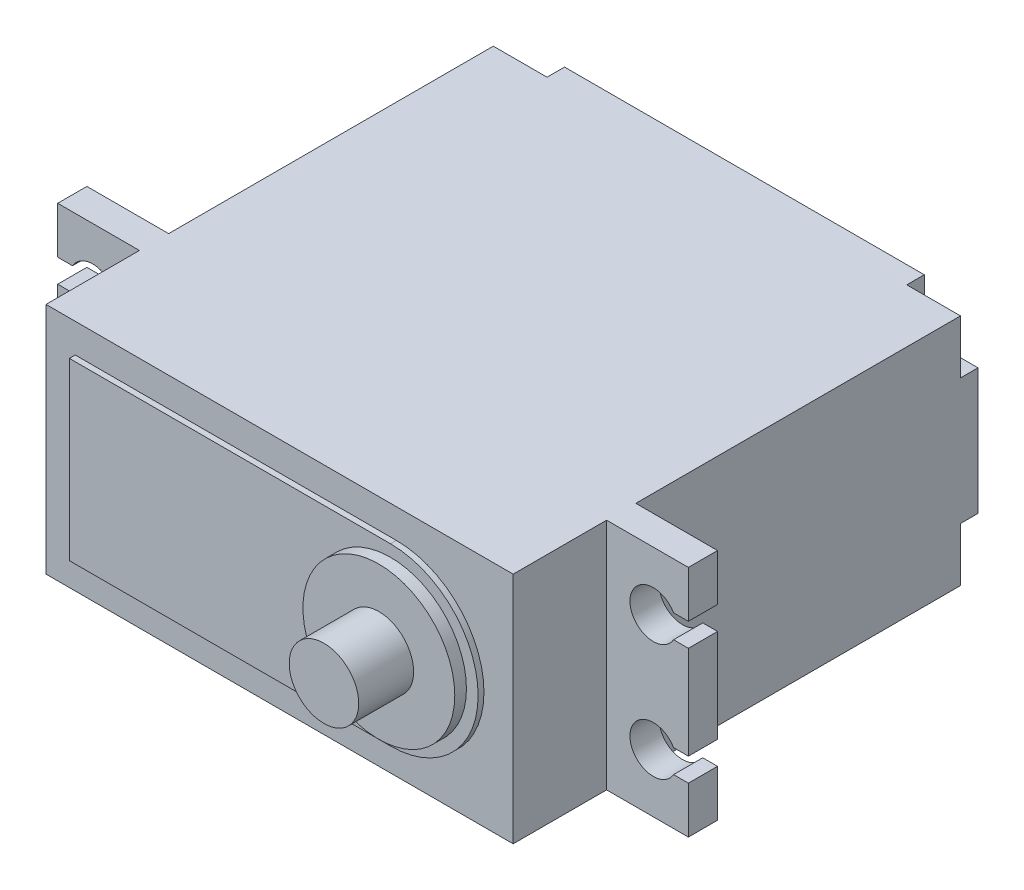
ISO-10303-21;
HEADER;
FILE_DESCRIPTION(('STEP AP214'),'2;1');
FILE_NAME('part.step','',(''),(''),'','','');
FILE_SCHEMA(('AUTOMOTIVE_DESIGN { 1 0 10303 214 1 1 1 1 }'));
ENDSEC;
DATA;
#1=APPLICATION_CONTEXT('core data for automotive mechanical design processes');
#2=APPLICATION_PROTOCOL_DEFINITION('international standard','automotive_design',2000,#1);
#3=PRODUCT_CONTEXT('',#1,'mechanical');
#4=PRODUCT('Part','Part','',(#3));
#5=PRODUCT_RELATED_PRODUCT_CATEGORY('part','',(#4));
#6=PRODUCT_DEFINITION_FORMATION('','',#4);
#7=PRODUCT_DEFINITION_CONTEXT('part definition',#1,'design');
#8=PRODUCT_DEFINITION('design','',#6,#7);
#9=PRODUCT_DEFINITION_SHAPE('','',#8);
#10=(LENGTH_UNIT() NAMED_UNIT(*) SI_UNIT(.MILLI.,.METRE.));
#11=(NAMED_UNIT(*) PLANE_ANGLE_UNIT() SI_UNIT($,.RADIAN.));
#12=(NAMED_UNIT(*) SI_UNIT($,.STERADIAN.) SOLID_ANGLE_UNIT());
#13=UNCERTAINTY_MEASURE_WITH_UNIT(LENGTH_MEASURE(1.E-05),#10,'distance_accuracy_value','');
#14=(GEOMETRIC_REPRESENTATION_CONTEXT(3) GLOBAL_UNCERTAINTY_ASSIGNED_CONTEXT((#13)) GLOBAL_UNIT_ASSIGNED_CONTEXT((#10,
#11,#12)) REPRESENTATION_CONTEXT('',''));
#15=CARTESIAN_POINT('',(0.,0.,0.));
#16=DIRECTION('',(0.,0.,1.));
#17=DIRECTION('',(1.,0.,0.));
#18=AXIS2_PLACEMENT_3D('',#15,#16,#17);
#19=CARTESIAN_POINT('',(0.,0.,39.8));
#20=DIRECTION('',(0.,0.,-1.));
#21=DIRECTION('',(-1.,0.,0.));
#22=AXIS2_PLACEMENT_3D('',#19,#20,#21);
#23=PLANE('',#22);
#24=DIRECTION('',(0.,1.,0.));
#25=VECTOR('',#24,1.);
#26=CARTESIAN_POINT('',(20.,-10.,39.8));
#27=LINE('',#26,#25);
#28=CARTESIAN_POINT('',(20.,-10.,39.8));
#29=VERTEX_POINT('',#28);
#30=CARTESIAN_POINT('',(20.,10.,39.8));
#31=VERTEX_POINT('',#30);
#32=EDGE_CURVE('E649',#29,#31,#27,.T.);
#33=ORIENTED_EDGE('',*,*,#32,.T.);
#34=DIRECTION('',(-1.,0.,0.));
#35=VECTOR('',#34,1.);
#36=CARTESIAN_POINT('',(-20.,10.,39.8));
#37=LINE('',#36,#35);
#38=CARTESIAN_POINT('',(-20.,10.,39.8));
#39=VERTEX_POINT('',#38);
#40=EDGE_CURVE('E652',#31,#39,#37,.T.);
#41=ORIENTED_EDGE('',*,*,#40,.T.);
#42=DIRECTION('',(0.,-1.,0.));
#43=VECTOR('',#42,1.);
#44=CARTESIAN_POINT('',(-20.,-10.,39.8));
#45=LINE('',#44,#43);
#46=CARTESIAN_POINT('',(-20.,-10.,39.8));
#47=VERTEX_POINT('',#46);
#48=EDGE_CURVE('E655',#39,#47,#45,.T.);
#49=ORIENTED_EDGE('',*,*,#48,.T.);
#50=DIRECTION('',(1.,0.,0.));
#51=VECTOR('',#50,1.);
#52=CARTESIAN_POINT('',(-20.,-10.,39.8));
#53=LINE('',#52,#51);
#54=EDGE_CURVE('E657',#47,#29,#53,.T.);
#55=ORIENTED_EDGE('',*,*,#54,.T.);
#56=EDGE_LOOP('',(#33,#41,#49,#55));
#57=FACE_BOUND('',#56,.T.);
#58=DIRECTION('',(0.,-1.,0.));
#59=VECTOR('',#58,1.);
#60=CARTESIAN_POINT('',(-17.5,-7.5,39.8));
#61=LINE('',#60,#59);
#62=CARTESIAN_POINT('',(-17.5,7.5,39.8));
#63=VERTEX_POINT('',#62);
#64=CARTESIAN_POINT('',(-17.5,-7.5,39.8));
#65=VERTEX_POINT('',#64);
#66=EDGE_CURVE('E59',#63,#65,#61,.T.);
#67=ORIENTED_EDGE('',*,*,#66,.F.);
#68=DIRECTION('',(-1.,0.,0.));
#69=VECTOR('',#68,1.);
#70=CARTESIAN_POINT('',(10.,7.5,39.8));
#71=LINE('',#70,#69);
#72=CARTESIAN_POINT('',(10.,7.5,39.8));
#73=VERTEX_POINT('',#72);
#74=EDGE_CURVE('E63',#73,#63,#71,.T.);
#75=ORIENTED_EDGE('',*,*,#74,.F.);
#76=CARTESIAN_POINT('',(10.,0.,39.8));
#77=DIRECTION('',(0.,0.,1.));
#78=DIRECTION('',(1.,0.,0.));
#79=AXIS2_PLACEMENT_3D('',#76,#77,#78);
#80=CIRCLE('',#79,7.5);
#81=CARTESIAN_POINT('',(10.,-7.5,39.8));
#82=VERTEX_POINT('',#81);
#83=EDGE_CURVE('E1248',#82,#73,#80,.T.);
#84=ORIENTED_EDGE('',*,*,#83,.F.);
#85=DIRECTION('',(1.,0.,0.));
#86=VECTOR('',#85,1.);
#87=CARTESIAN_POINT('',(10.,-7.5,39.8));
#88=LINE('',#87,#86);
#89=EDGE_CURVE('E1246',#65,#82,#88,.T.);
#90=ORIENTED_EDGE('',*,*,#89,.F.);
#91=EDGE_LOOP('',(#67,#75,#84,#90));
#92=FACE_BOUND('',#91,.T.);
#93=ADVANCED_FACE('F43',(#57,#92),#23,.F.);
#94=CARTESIAN_POINT('',(27.,10.,29.3));
#95=DIRECTION('',(0.,0.,-1.));
#96=DIRECTION('',(0.,1.,0.));
#97=AXIS2_PLACEMENT_3D('',#94,#95,#96);
#98=PLANE('',#97);
#99=DIRECTION('',(0.,-1.,0.));
#100=VECTOR('',#99,1.);
#101=CARTESIAN_POINT('',(27.,10.,29.3));
#102=LINE('',#101,#100);
#103=CARTESIAN_POINT('',(27.,10.,29.3));
#104=VERTEX_POINT('',#103);
#105=CARTESIAN_POINT('',(27.,6.,29.3));
#106=VERTEX_POINT('',#105);
#107=EDGE_CURVE('E419',#104,#106,#102,.T.);
#108=ORIENTED_EDGE('',*,*,#107,.T.);
#109=DIRECTION('',(-1.,0.,0.));
#110=VECTOR('',#109,1.);
#111=CARTESIAN_POINT('',(27.,6.,29.3));
#112=LINE('',#111,#110);
#113=CARTESIAN_POINT('',(25.7320508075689,6.,29.3));
#114=VERTEX_POINT('',#113);
#115=EDGE_CURVE('E409',#106,#114,#112,.T.);
#116=ORIENTED_EDGE('',*,*,#115,.T.);
#117=CARTESIAN_POINT('',(24.,5.,29.3));
#118=DIRECTION('',(0.,0.,-1.));
#119=DIRECTION('',(0.,1.,0.));
#120=AXIS2_PLACEMENT_3D('',#117,#118,#119);
#121=CIRCLE('',#120,2.);
#122=CARTESIAN_POINT('',(25.7320508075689,4.,29.3));
#123=VERTEX_POINT('',#122);
#124=EDGE_CURVE('E415',#114,#123,#121,.F.);
#125=ORIENTED_EDGE('',*,*,#124,.T.);
#126=DIRECTION('',(1.,0.,0.));
#127=VECTOR('',#126,1.);
#128=CARTESIAN_POINT('',(27.,4.,29.3));
#129=LINE('',#128,#127);
#130=CARTESIAN_POINT('',(27.,4.,29.3));
#131=VERTEX_POINT('',#130);
#132=EDGE_CURVE('E406',#123,#131,#129,.T.);
#133=ORIENTED_EDGE('',*,*,#132,.T.);
#134=CARTESIAN_POINT('',(27.,-4.,29.3));
#135=VERTEX_POINT('',#134);
#136=EDGE_CURVE('E423',#131,#135,#102,.T.);
#137=ORIENTED_EDGE('',*,*,#136,.T.);
#138=DIRECTION('',(-1.,0.,0.));
#139=VECTOR('',#138,1.);
#140=CARTESIAN_POINT('',(27.,-4.,29.3));
#141=LINE('',#140,#139);
#142=CARTESIAN_POINT('',(25.7320508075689,-4.,29.3));
#143=VERTEX_POINT('',#142);
#144=EDGE_CURVE('E391',#135,#143,#141,.T.);
#145=ORIENTED_EDGE('',*,*,#144,.T.);
#146=CARTESIAN_POINT('',(24.,-5.,29.3));
#147=DIRECTION('',(0.,0.,-1.));
#148=DIRECTION('',(0.,1.,0.));
#149=AXIS2_PLACEMENT_3D('',#146,#147,#148);
#150=CIRCLE('',#149,2.);
#151=CARTESIAN_POINT('',(25.7320508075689,-6.,29.3));
#152=VERTEX_POINT('',#151);
#153=EDGE_CURVE('E412',#143,#152,#150,.F.);
#154=ORIENTED_EDGE('',*,*,#153,.T.);
#155=DIRECTION('',(1.,0.,0.));
#156=VECTOR('',#155,1.);
#157=CARTESIAN_POINT('',(27.,-6.,29.3));
#158=LINE('',#157,#156);
#159=CARTESIAN_POINT('',(27.,-6.,29.3));
#160=VERTEX_POINT('',#159);
#161=EDGE_CURVE('E403',#152,#160,#158,.T.);
#162=ORIENTED_EDGE('',*,*,#161,.T.);
#163=CARTESIAN_POINT('',(27.,-10.,29.3));
#164=VERTEX_POINT('',#163);
#165=EDGE_CURVE('E424',#160,#164,#102,.T.);
#166=ORIENTED_EDGE('',*,*,#165,.T.);
#167=DIRECTION('',(-1.,0.,0.));
#168=VECTOR('',#167,1.);
#169=CARTESIAN_POINT('',(27.,-10.,29.3));
#170=LINE('',#169,#168);
#171=CARTESIAN_POINT('',(20.,-10.,29.3));
#172=VERTEX_POINT('',#171);
#173=EDGE_CURVE('E435',#164,#172,#170,.T.);
#174=ORIENTED_EDGE('',*,*,#173,.T.);
#175=DIRECTION('',(0.,-1.,0.));
#176=VECTOR('',#175,1.);
#177=CARTESIAN_POINT('',(20.,10.,29.3));
#178=LINE('',#177,#176);
#179=CARTESIAN_POINT('',(20.,10.,29.3));
#180=VERTEX_POINT('',#179);
#181=EDGE_CURVE('E418',#180,#172,#178,.T.);
#182=ORIENTED_EDGE('',*,*,#181,.F.);
#183=DIRECTION('',(-1.,0.,0.));
#184=VECTOR('',#183,1.);
#185=CARTESIAN_POINT('',(27.,10.,29.3));
#186=LINE('',#185,#184);
#187=EDGE_CURVE('E446',#104,#180,#186,.T.);
#188=ORIENTED_EDGE('',*,*,#187,.F.);
#189=EDGE_LOOP('',(#108,#116,#125,#133,#137,#145,#154,#162,#166,#174,#182,#188));
#190=FACE_BOUND('',#189,.T.);
#191=ADVANCED_FACE('F721',(#190),#98,.T.);
#192=CARTESIAN_POINT('',(27.,10.,31.8));
#193=DIRECTION('',(0.,0.,1.));
#194=DIRECTION('',(1.,0.,0.));
#195=AXIS2_PLACEMENT_3D('',#192,#193,#194);
#196=PLANE('',#195);
#197=CARTESIAN_POINT('',(24.,5.,31.8));
#198=DIRECTION('',(0.,0.,-1.));
#199=DIRECTION('',(-1.,0.,0.));
#200=AXIS2_PLACEMENT_3D('',#197,#198,#199);
#201=CIRCLE('',#200,2.);
#202=CARTESIAN_POINT('',(25.7320508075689,4.,31.8));
#203=VERTEX_POINT('',#202);
#204=CARTESIAN_POINT('',(25.7320508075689,6.,31.8));
#205=VERTEX_POINT('',#204);
#206=EDGE_CURVE('E381',#203,#205,#201,.T.);
#207=ORIENTED_EDGE('',*,*,#206,.T.);
#208=DIRECTION('',(1.,0.,0.));
#209=VECTOR('',#208,1.);
#210=CARTESIAN_POINT('',(25.7320508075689,6.,31.8));
#211=LINE('',#210,#209);
#212=CARTESIAN_POINT('',(27.,6.,31.8));
#213=VERTEX_POINT('',#212);
#214=EDGE_CURVE('E378',#205,#213,#211,.T.);
#215=ORIENTED_EDGE('',*,*,#214,.T.);
#216=DIRECTION('',(0.,1.,0.));
#217=VECTOR('',#216,1.);
#218=CARTESIAN_POINT('',(27.,10.,31.8));
#219=LINE('',#218,#217);
#220=CARTESIAN_POINT('',(27.,10.,31.8));
#221=VERTEX_POINT('',#220);
#222=EDGE_CURVE('E427',#213,#221,#219,.T.);
#223=ORIENTED_EDGE('',*,*,#222,.T.);
#224=DIRECTION('',(-1.,0.,0.));
#225=VECTOR('',#224,1.);
#226=CARTESIAN_POINT('',(27.,10.,31.8));
#227=LINE('',#226,#225);
#228=CARTESIAN_POINT('',(20.,10.,31.8));
#229=VERTEX_POINT('',#228);
#230=EDGE_CURVE('E444',#221,#229,#227,.T.);
#231=ORIENTED_EDGE('',*,*,#230,.T.);
#232=DIRECTION('',(0.,1.,0.));
#233=VECTOR('',#232,1.);
#234=CARTESIAN_POINT('',(20.,10.,31.8));
#235=LINE('',#234,#233);
#236=CARTESIAN_POINT('',(20.,-10.,31.8));
#237=VERTEX_POINT('',#236);
#238=EDGE_CURVE('E438',#237,#229,#235,.T.);
#239=ORIENTED_EDGE('',*,*,#238,.F.);
#240=DIRECTION('',(-1.,0.,0.));
#241=VECTOR('',#240,1.);
#242=CARTESIAN_POINT('',(27.,-10.,31.8));
#243=LINE('',#242,#241);
#244=CARTESIAN_POINT('',(27.,-10.,31.8));
#245=VERTEX_POINT('',#244);
#246=EDGE_CURVE('E442',#245,#237,#243,.T.);
#247=ORIENTED_EDGE('',*,*,#246,.F.);
#248=CARTESIAN_POINT('',(27.,-6.,31.8));
#249=VERTEX_POINT('',#248);
#250=EDGE_CURVE('E428',#245,#249,#219,.T.);
#251=ORIENTED_EDGE('',*,*,#250,.T.);
#252=DIRECTION('',(-1.,0.,0.));
#253=VECTOR('',#252,1.);
#254=CARTESIAN_POINT('',(25.7320508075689,-6.,31.8));
#255=LINE('',#254,#253);
#256=CARTESIAN_POINT('',(25.7320508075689,-6.,31.8));
#257=VERTEX_POINT('',#256);
#258=EDGE_CURVE('E395',#249,#257,#255,.T.);
#259=ORIENTED_EDGE('',*,*,#258,.T.);
#260=CARTESIAN_POINT('',(24.,-5.,31.8));
#261=DIRECTION('',(0.,0.,-1.));
#262=DIRECTION('',(-1.,0.,0.));
#263=AXIS2_PLACEMENT_3D('',#260,#261,#262);
#264=CIRCLE('',#263,2.);
#265=CARTESIAN_POINT('',(25.7320508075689,-4.,31.8));
#266=VERTEX_POINT('',#265);
#267=EDGE_CURVE('E372',#257,#266,#264,.T.);
#268=ORIENTED_EDGE('',*,*,#267,.T.);
#269=DIRECTION('',(1.,0.,0.));
#270=VECTOR('',#269,1.);
#271=CARTESIAN_POINT('',(25.7320508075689,-4.,31.8));
#272=LINE('',#271,#270);
#273=CARTESIAN_POINT('',(27.,-4.,31.8));
#274=VERTEX_POINT('',#273);
#275=EDGE_CURVE('E369',#266,#274,#272,.T.);
#276=ORIENTED_EDGE('',*,*,#275,.T.);
#277=CARTESIAN_POINT('',(27.,4.,31.8));
#278=VERTEX_POINT('',#277);
#279=EDGE_CURVE('E432',#274,#278,#219,.T.);
#280=ORIENTED_EDGE('',*,*,#279,.T.);
#281=DIRECTION('',(-1.,0.,0.));
#282=VECTOR('',#281,1.);
#283=CARTESIAN_POINT('',(25.7320508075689,4.,31.8));
#284=LINE('',#283,#282);
#285=EDGE_CURVE('E385',#278,#203,#284,.T.);
#286=ORIENTED_EDGE('',*,*,#285,.T.);
#287=EDGE_LOOP('',(#207,#215,#223,#231,#239,#247,#251,#259,#268,#276,#280,#286));
#288=FACE_BOUND('',#287,.T.);
#289=ADVANCED_FACE('F707',(#288),#196,.T.);
#290=CARTESIAN_POINT('',(27.,0.,0.));
#291=DIRECTION('',(1.,0.,0.));
#292=DIRECTION('',(0.,0.,1.));
#293=AXIS2_PLACEMENT_3D('',#290,#291,#292);
#294=PLANE('',#293);
#295=ORIENTED_EDGE('',*,*,#222,.F.);
#296=DIRECTION('',(0.,0.,-1.));
#297=VECTOR('',#296,1.);
#298=CARTESIAN_POINT('',(27.,6.,0.));
#299=LINE('',#298,#297);
#300=EDGE_CURVE('E11',#213,#106,#299,.T.);
#301=ORIENTED_EDGE('',*,*,#300,.T.);
#302=ORIENTED_EDGE('',*,*,#107,.F.);
#303=DIRECTION('',(0.,0.,-1.));
#304=VECTOR('',#303,1.);
#305=CARTESIAN_POINT('',(27.,10.,29.3));
#306=LINE('',#305,#304);
#307=EDGE_CURVE('E422',#221,#104,#306,.T.);
#308=ORIENTED_EDGE('',*,*,#307,.F.);
#309=EDGE_LOOP('',(#295,#301,#302,#308));
#310=FACE_BOUND('',#309,.T.);
#311=ADVANCED_FACE('F719',(#310),#294,.T.);
#312=ORIENTED_EDGE('',*,*,#136,.F.);
#313=DIRECTION('',(0.,0.,1.));
#314=VECTOR('',#313,1.);
#315=CARTESIAN_POINT('',(27.,4.,0.));
#316=LINE('',#315,#314);
#317=EDGE_CURVE('E52',#131,#278,#316,.T.);
#318=ORIENTED_EDGE('',*,*,#317,.T.);
#319=ORIENTED_EDGE('',*,*,#279,.F.);
#320=DIRECTION('',(0.,0.,-1.));
#321=VECTOR('',#320,1.);
#322=CARTESIAN_POINT('',(27.,-4.,0.));
#323=LINE('',#322,#321);
#324=EDGE_CURVE('E692',#274,#135,#323,.T.);
#325=ORIENTED_EDGE('',*,*,#324,.T.);
#326=EDGE_LOOP('',(#312,#318,#319,#325));
#327=FACE_BOUND('',#326,.T.);
#328=ADVANCED_FACE('F703',(#327),#294,.T.);
#329=ORIENTED_EDGE('',*,*,#165,.F.);
#330=DIRECTION('',(0.,0.,1.));
#331=VECTOR('',#330,1.);
#332=CARTESIAN_POINT('',(27.,-6.,0.));
#333=LINE('',#332,#331);
#334=EDGE_CURVE('E695',#160,#249,#333,.T.);
#335=ORIENTED_EDGE('',*,*,#334,.T.);
#336=ORIENTED_EDGE('',*,*,#250,.F.);
#337=DIRECTION('',(0.,0.,1.));
#338=VECTOR('',#337,1.);
#339=CARTESIAN_POINT('',(27.,-10.,29.3));
#340=LINE('',#339,#338);
#341=EDGE_CURVE('E431',#164,#245,#340,.T.);
#342=ORIENTED_EDGE('',*,*,#341,.F.);
#343=EDGE_LOOP('',(#329,#335,#336,#342));
#344=FACE_BOUND('',#343,.T.);
#345=ADVANCED_FACE('F800',(#344),#294,.T.);
#346=CARTESIAN_POINT('',(20.,-10.,39.8));
#347=DIRECTION('',(-1.,0.,0.));
#348=DIRECTION('',(0.,0.,1.));
#349=AXIS2_PLACEMENT_3D('',#346,#347,#348);
#350=PLANE('',#349);
#351=DIRECTION('',(0.,0.,-1.));
#352=VECTOR('',#351,1.);
#353=CARTESIAN_POINT('',(20.,10.,39.8));
#354=LINE('',#353,#352);
#355=CARTESIAN_POINT('',(20.,10.,1.5));
#356=VERTEX_POINT('',#355);
#357=EDGE_CURVE('E680',#180,#356,#354,.T.);
#358=ORIENTED_EDGE('',*,*,#357,.F.);
#359=ORIENTED_EDGE('',*,*,#181,.T.);
#360=DIRECTION('',(0.,0.,-1.));
#361=VECTOR('',#360,1.);
#362=CARTESIAN_POINT('',(20.,-10.,39.8));
#363=LINE('',#362,#361);
#364=CARTESIAN_POINT('',(20.,-10.,1.5));
#365=VERTEX_POINT('',#364);
#366=EDGE_CURVE('E659',#172,#365,#363,.T.);
#367=ORIENTED_EDGE('',*,*,#366,.T.);
#368=DIRECTION('',(0.,-1.,0.));
#369=VECTOR('',#368,1.);
#370=CARTESIAN_POINT('',(20.,0.,1.5));
#371=LINE('',#370,#369);
#372=CARTESIAN_POINT('',(20.,-5.4,1.5));
#373=VERTEX_POINT('',#372);
#374=EDGE_CURVE('E594',#373,#365,#371,.T.);
#375=ORIENTED_EDGE('',*,*,#374,.F.);
#376=DIRECTION('',(0.,0.,-1.));
#377=VECTOR('',#376,1.);
#378=CARTESIAN_POINT('',(20.,-5.4,1.5));
#379=LINE('',#378,#377);
#380=CARTESIAN_POINT('',(20.,-5.4,0.));
#381=VERTEX_POINT('',#380);
#382=EDGE_CURVE('E612',#373,#381,#379,.T.);
#383=ORIENTED_EDGE('',*,*,#382,.T.);
#384=DIRECTION('',(0.,1.,0.));
#385=VECTOR('',#384,1.);
#386=CARTESIAN_POINT('',(20.,-10.,0.));
#387=LINE('',#386,#385);
#388=CARTESIAN_POINT('',(20.,5.4,0.));
#389=VERTEX_POINT('',#388);
#390=EDGE_CURVE('E641',#381,#389,#387,.T.);
#391=ORIENTED_EDGE('',*,*,#390,.T.);
#392=DIRECTION('',(0.,0.,-1.));
#393=VECTOR('',#392,1.);
#394=CARTESIAN_POINT('',(20.,5.4,1.5));
#395=LINE('',#394,#393);
#396=CARTESIAN_POINT('',(20.,5.4,1.5));
#397=VERTEX_POINT('',#396);
#398=EDGE_CURVE('E542',#397,#389,#395,.T.);
#399=ORIENTED_EDGE('',*,*,#398,.F.);
#400=DIRECTION('',(0.,-1.,0.));
#401=VECTOR('',#400,1.);
#402=CARTESIAN_POINT('',(20.,0.,1.5));
#403=LINE('',#402,#401);
#404=EDGE_CURVE('E567',#356,#397,#403,.T.);
#405=ORIENTED_EDGE('',*,*,#404,.F.);
#406=EDGE_LOOP('',(#358,#359,#367,#375,#383,#391,#399,#405));
#407=FACE_BOUND('',#406,.T.);
#408=ADVANCED_FACE('F732',(#407),#350,.F.);
#409=CARTESIAN_POINT('',(-27.,0.,0.));
#410=DIRECTION('',(-1.,0.,0.));
#411=DIRECTION('',(0.,0.,1.));
#412=AXIS2_PLACEMENT_3D('',#409,#410,#411);
#413=PLANE('',#412);
#414=DIRECTION('',(0.,0.,-1.));
#415=VECTOR('',#414,1.);
#416=CARTESIAN_POINT('',(-27.,6.,0.));
#417=LINE('',#416,#415);
#418=CARTESIAN_POINT('',(-27.,6.,31.8));
#419=VERTEX_POINT('',#418);
#420=CARTESIAN_POINT('',(-27.,6.,29.3));
#421=VERTEX_POINT('',#420);
#422=EDGE_CURVE('E690',#419,#421,#417,.T.);
#423=ORIENTED_EDGE('',*,*,#422,.F.);
#424=DIRECTION('',(0.,1.,0.));
#425=VECTOR('',#424,1.);
#426=CARTESIAN_POINT('',(-27.,10.,31.8));
#427=LINE('',#426,#425);
#428=CARTESIAN_POINT('',(-27.,10.,31.8));
#429=VERTEX_POINT('',#428);
#430=EDGE_CURVE('E498',#419,#429,#427,.T.);
#431=ORIENTED_EDGE('',*,*,#430,.T.);
#432=DIRECTION('',(0.,0.,-1.));
#433=VECTOR('',#432,1.);
#434=CARTESIAN_POINT('',(-27.,10.,29.3));
#435=LINE('',#434,#433);
#436=CARTESIAN_POINT('',(-27.,10.,29.3));
#437=VERTEX_POINT('',#436);
#438=EDGE_CURVE('E502',#429,#437,#435,.T.);
#439=ORIENTED_EDGE('',*,*,#438,.T.);
#440=DIRECTION('',(0.,-1.,0.));
#441=VECTOR('',#440,1.);
#442=CARTESIAN_POINT('',(-27.,10.,29.3));
#443=LINE('',#442,#441);
#444=EDGE_CURVE('E491',#437,#421,#443,.T.);
#445=ORIENTED_EDGE('',*,*,#444,.T.);
#446=EDGE_LOOP('',(#423,#431,#439,#445));
#447=FACE_BOUND('',#446,.T.);
#448=ADVANCED_FACE('F777',(#447),#413,.T.);
#449=DIRECTION('',(0.,0.,1.));
#450=VECTOR('',#449,1.);
#451=CARTESIAN_POINT('',(-27.,4.,0.));
#452=LINE('',#451,#450);
#453=CARTESIAN_POINT('',(-27.,4.,29.3));
#454=VERTEX_POINT('',#453);
#455=CARTESIAN_POINT('',(-27.,4.,31.8));
#456=VERTEX_POINT('',#455);
#457=EDGE_CURVE('E688',#454,#456,#452,.T.);
#458=ORIENTED_EDGE('',*,*,#457,.F.);
#459=CARTESIAN_POINT('',(-27.,-4.,29.3));
#460=VERTEX_POINT('',#459);
#461=EDGE_CURVE('E495',#454,#460,#443,.T.);
#462=ORIENTED_EDGE('',*,*,#461,.T.);
#463=DIRECTION('',(0.,0.,-1.));
#464=VECTOR('',#463,1.);
#465=CARTESIAN_POINT('',(-27.,-4.,0.));
#466=LINE('',#465,#464);
#467=CARTESIAN_POINT('',(-27.,-4.,31.8));
#468=VERTEX_POINT('',#467);
#469=EDGE_CURVE('E686',#468,#460,#466,.T.);
#470=ORIENTED_EDGE('',*,*,#469,.F.);
#471=EDGE_CURVE('E503',#468,#456,#427,.T.);
#472=ORIENTED_EDGE('',*,*,#471,.T.);
#473=EDGE_LOOP('',(#458,#462,#470,#472));
#474=FACE_BOUND('',#473,.T.);
#475=ADVANCED_FACE('F845',(#474),#413,.T.);
#476=CARTESIAN_POINT('',(-20.,-10.,39.8));
#477=DIRECTION('',(1.,0.,0.));
#478=DIRECTION('',(0.,0.,-1.));
#479=AXIS2_PLACEMENT_3D('',#476,#477,#478);
#480=PLANE('',#479);
#481=DIRECTION('',(0.,-1.,0.));
#482=VECTOR('',#481,1.);
#483=CARTESIAN_POINT('',(-20.,10.,29.3));
#484=LINE('',#483,#482);
#485=CARTESIAN_POINT('',(-20.,10.,29.3));
#486=VERTEX_POINT('',#485);
#487=CARTESIAN_POINT('',(-20.,-10.,29.3));
#488=VERTEX_POINT('',#487);
#489=EDGE_CURVE('E490',#486,#488,#484,.T.);
#490=ORIENTED_EDGE('',*,*,#489,.F.);
#491=DIRECTION('',(0.,0.,-1.));
#492=VECTOR('',#491,1.);
#493=CARTESIAN_POINT('',(-20.,10.,39.8));
#494=LINE('',#493,#492);
#495=CARTESIAN_POINT('',(-20.,10.,1.5));
#496=VERTEX_POINT('',#495);
#497=EDGE_CURVE('E677',#486,#496,#494,.T.);
#498=ORIENTED_EDGE('',*,*,#497,.T.);
#499=DIRECTION('',(0.,1.,0.));
#500=VECTOR('',#499,1.);
#501=CARTESIAN_POINT('',(-20.,0.,1.5));
#502=LINE('',#501,#500);
#503=CARTESIAN_POINT('',(-20.,5.39999999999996,1.5));
#504=VERTEX_POINT('',#503);
#505=EDGE_CURVE('E529',#504,#496,#502,.T.);
#506=ORIENTED_EDGE('',*,*,#505,.F.);
#507=DIRECTION('',(0.,0.,-1.));
#508=VECTOR('',#507,1.);
#509=CARTESIAN_POINT('',(-20.,5.39999999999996,1.5));
#510=LINE('',#509,#508);
#511=CARTESIAN_POINT('',(-20.,5.39999999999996,0.));
#512=VERTEX_POINT('',#511);
#513=EDGE_CURVE('E551',#504,#512,#510,.T.);
#514=ORIENTED_EDGE('',*,*,#513,.T.);
#515=DIRECTION('',(0.,-1.,0.));
#516=VECTOR('',#515,1.);
#517=CARTESIAN_POINT('',(-20.,-10.,0.));
#518=LINE('',#517,#516);
#519=CARTESIAN_POINT('',(-20.,-5.39999999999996,0.));
#520=VERTEX_POINT('',#519);
#521=EDGE_CURVE('E665',#512,#520,#518,.T.);
#522=ORIENTED_EDGE('',*,*,#521,.T.);
#523=DIRECTION('',(0.,0.,-1.));
#524=VECTOR('',#523,1.);
#525=CARTESIAN_POINT('',(-20.,-5.39999999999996,1.5));
#526=LINE('',#525,#524);
#527=CARTESIAN_POINT('',(-20.,-5.39999999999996,1.5));
#528=VERTEX_POINT('',#527);
#529=EDGE_CURVE('E639',#528,#520,#526,.T.);
#530=ORIENTED_EDGE('',*,*,#529,.F.);
#531=DIRECTION('',(0.,1.,0.));
#532=VECTOR('',#531,1.);
#533=CARTESIAN_POINT('',(-20.,0.,1.5));
#534=LINE('',#533,#532);
#535=CARTESIAN_POINT('',(-20.,-10.,1.5));
#536=VERTEX_POINT('',#535);
#537=EDGE_CURVE('E628',#536,#528,#534,.T.);
#538=ORIENTED_EDGE('',*,*,#537,.F.);
#539=DIRECTION('',(0.,0.,-1.));
#540=VECTOR('',#539,1.);
#541=CARTESIAN_POINT('',(-20.,-10.,39.8));
#542=LINE('',#541,#540);
#543=EDGE_CURVE('E673',#488,#536,#542,.T.);
#544=ORIENTED_EDGE('',*,*,#543,.F.);
#545=EDGE_LOOP('',(#490,#498,#506,#514,#522,#530,#538,#544));
#546=FACE_BOUND('',#545,.T.);
#547=ADVANCED_FACE('F764',(#546),#480,.F.);
#548=DIRECTION('',(0.,1.,0.));
#549=VECTOR('',#548,1.);
#550=CARTESIAN_POINT('',(-20.,10.,31.8));
#551=LINE('',#550,#549);
#552=CARTESIAN_POINT('',(-20.,-10.,31.8));
#553=VERTEX_POINT('',#552);
#554=CARTESIAN_POINT('',(-20.,10.,31.8));
#555=VERTEX_POINT('',#554);
#556=EDGE_CURVE('E508',#553,#555,#551,.T.);
#557=ORIENTED_EDGE('',*,*,#556,.F.);
#558=EDGE_CURVE('E674',#47,#553,#542,.T.);
#559=ORIENTED_EDGE('',*,*,#558,.F.);
#560=ORIENTED_EDGE('',*,*,#48,.F.);
#561=EDGE_CURVE('E678',#39,#555,#494,.T.);
#562=ORIENTED_EDGE('',*,*,#561,.T.);
#563=EDGE_LOOP('',(#557,#559,#560,#562));
#564=FACE_BOUND('',#563,.T.);
#565=ADVANCED_FACE('F786',(#564),#480,.F.);
#566=EDGE_CURVE('E670',#29,#237,#363,.T.);
#567=ORIENTED_EDGE('',*,*,#566,.T.);
#568=ORIENTED_EDGE('',*,*,#238,.T.);
#569=EDGE_CURVE('E681',#31,#229,#354,.T.);
#570=ORIENTED_EDGE('',*,*,#569,.F.);
#571=ORIENTED_EDGE('',*,*,#32,.F.);
#572=EDGE_LOOP('',(#567,#568,#570,#571));
#573=FACE_BOUND('',#572,.T.);
#574=ADVANCED_FACE('F45',(#573),#350,.F.);
#575=CARTESIAN_POINT('',(-20.,10.,39.8));
#576=DIRECTION('',(0.,-1.,0.));
#577=DIRECTION('',(0.,0.,-1.));
#578=AXIS2_PLACEMENT_3D('',#575,#576,#577);
#579=PLANE('',#578);
#580=DIRECTION('',(0.,0.,-1.));
#581=VECTOR('',#580,1.);
#582=CARTESIAN_POINT('',(15.4,10.,1.5));
#583=LINE('',#582,#581);
#584=CARTESIAN_POINT('',(15.4,10.,1.5));
#585=VERTEX_POINT('',#584);
#586=CARTESIAN_POINT('',(15.4,10.,0.));
#587=VERTEX_POINT('',#586);
#588=EDGE_CURVE('E581',#585,#587,#583,.T.);
#589=ORIENTED_EDGE('',*,*,#588,.T.);
#590=DIRECTION('',(-1.,0.,0.));
#591=VECTOR('',#590,1.);
#592=CARTESIAN_POINT('',(-20.,10.,0.));
#593=LINE('',#592,#591);
#594=CARTESIAN_POINT('',(-15.4,10.,0.));
#595=VERTEX_POINT('',#594);
#596=EDGE_CURVE('E662',#587,#595,#593,.T.);
#597=ORIENTED_EDGE('',*,*,#596,.T.);
#598=DIRECTION('',(0.,0.,-1.));
#599=VECTOR('',#598,1.);
#600=CARTESIAN_POINT('',(-15.4,10.,1.5));
#601=LINE('',#600,#599);
#602=CARTESIAN_POINT('',(-15.4,10.,1.5));
#603=VERTEX_POINT('',#602);
#604=EDGE_CURVE('E549',#603,#595,#601,.T.);
#605=ORIENTED_EDGE('',*,*,#604,.F.);
#606=DIRECTION('',(1.,0.,0.));
#607=VECTOR('',#606,1.);
#608=CARTESIAN_POINT('',(0.,10.,1.5));
#609=LINE('',#608,#607);
#610=EDGE_CURVE('E532',#496,#603,#609,.T.);
#611=ORIENTED_EDGE('',*,*,#610,.F.);
#612=ORIENTED_EDGE('',*,*,#497,.F.);
#613=DIRECTION('',(1.,0.,0.));
#614=VECTOR('',#613,1.);
#615=CARTESIAN_POINT('',(-27.,10.,29.3));
#616=LINE('',#615,#614);
#617=EDGE_CURVE('E505',#437,#486,#616,.T.);
#618=ORIENTED_EDGE('',*,*,#617,.F.);
#619=ORIENTED_EDGE('',*,*,#438,.F.);
#620=DIRECTION('',(1.,0.,0.));
#621=VECTOR('',#620,1.);
#622=CARTESIAN_POINT('',(-27.,10.,31.8));
#623=LINE('',#622,#621);
#624=EDGE_CURVE('E513',#429,#555,#623,.T.);
#625=ORIENTED_EDGE('',*,*,#624,.T.);
#626=ORIENTED_EDGE('',*,*,#561,.F.);
#627=ORIENTED_EDGE('',*,*,#40,.F.);
#628=ORIENTED_EDGE('',*,*,#569,.T.);
#629=ORIENTED_EDGE('',*,*,#230,.F.);
#630=ORIENTED_EDGE('',*,*,#307,.T.);
#631=ORIENTED_EDGE('',*,*,#187,.T.);
#632=ORIENTED_EDGE('',*,*,#357,.T.);
#633=DIRECTION('',(1.,0.,0.));
#634=VECTOR('',#633,1.);
#635=CARTESIAN_POINT('',(0.,10.,1.5));
#636=LINE('',#635,#634);
#637=EDGE_CURVE('E564',#585,#356,#636,.T.);
#638=ORIENTED_EDGE('',*,*,#637,.F.);
#639=EDGE_LOOP('',(#589,#597,#605,#611,#612,#618,#619,#625,#626,#627,#628,#629,#630,#631,#632,#638));
#640=FACE_BOUND('',#639,.T.);
#641=ADVANCED_FACE('F716',(#640),#579,.F.);
#642=CARTESIAN_POINT('',(-20.,-10.,39.8));
#643=DIRECTION('',(0.,1.,0.));
#644=DIRECTION('',(0.,0.,1.));
#645=AXIS2_PLACEMENT_3D('',#642,#643,#644);
#646=PLANE('',#645);
#647=DIRECTION('',(1.,0.,0.));
#648=VECTOR('',#647,1.);
#649=CARTESIAN_POINT('',(-20.,-10.,0.));
#650=LINE('',#649,#648);
#651=CARTESIAN_POINT('',(-15.4,-10.,0.));
#652=VERTEX_POINT('',#651);
#653=CARTESIAN_POINT('',(15.4,-10.,0.));
#654=VERTEX_POINT('',#653);
#655=EDGE_CURVE('E653',#652,#654,#650,.T.);
#656=ORIENTED_EDGE('',*,*,#655,.T.);
#657=DIRECTION('',(0.,0.,-1.));
#658=VECTOR('',#657,1.);
#659=CARTESIAN_POINT('',(15.4,-10.,1.5));
#660=LINE('',#659,#658);
#661=CARTESIAN_POINT('',(15.4,-10.,1.5));
#662=VERTEX_POINT('',#661);
#663=EDGE_CURVE('E610',#662,#654,#660,.T.);
#664=ORIENTED_EDGE('',*,*,#663,.F.);
#665=DIRECTION('',(-1.,0.,0.));
#666=VECTOR('',#665,1.);
#667=CARTESIAN_POINT('',(0.,-10.,1.5));
#668=LINE('',#667,#666);
#669=EDGE_CURVE('E597',#365,#662,#668,.T.);
#670=ORIENTED_EDGE('',*,*,#669,.F.);
#671=ORIENTED_EDGE('',*,*,#366,.F.);
#672=ORIENTED_EDGE('',*,*,#173,.F.);
#673=ORIENTED_EDGE('',*,*,#341,.T.);
#674=ORIENTED_EDGE('',*,*,#246,.T.);
#675=ORIENTED_EDGE('',*,*,#566,.F.);
#676=ORIENTED_EDGE('',*,*,#54,.F.);
#677=ORIENTED_EDGE('',*,*,#558,.T.);
#678=DIRECTION('',(1.,0.,0.));
#679=VECTOR('',#678,1.);
#680=CARTESIAN_POINT('',(-27.,-10.,31.8));
#681=LINE('',#680,#679);
#682=CARTESIAN_POINT('',(-27.,-10.,31.8));
#683=VERTEX_POINT('',#682);
#684=EDGE_CURVE('E516',#683,#553,#681,.T.);
#685=ORIENTED_EDGE('',*,*,#684,.F.);
#686=DIRECTION('',(0.,0.,1.));
#687=VECTOR('',#686,1.);
#688=CARTESIAN_POINT('',(-27.,-10.,29.3));
#689=LINE('',#688,#687);
#690=CARTESIAN_POINT('',(-27.,-10.,29.3));
#691=VERTEX_POINT('',#690);
#692=EDGE_CURVE('E494',#691,#683,#689,.T.);
#693=ORIENTED_EDGE('',*,*,#692,.F.);
#694=DIRECTION('',(1.,0.,0.));
#695=VECTOR('',#694,1.);
#696=CARTESIAN_POINT('',(-27.,-10.,29.3));
#697=LINE('',#696,#695);
#698=EDGE_CURVE('E519',#691,#488,#697,.T.);
#699=ORIENTED_EDGE('',*,*,#698,.T.);
#700=ORIENTED_EDGE('',*,*,#543,.T.);
#701=DIRECTION('',(-1.,0.,0.));
#702=VECTOR('',#701,1.);
#703=CARTESIAN_POINT('',(0.,-10.,1.5));
#704=LINE('',#703,#702);
#705=CARTESIAN_POINT('',(-15.4,-10.,1.5));
#706=VERTEX_POINT('',#705);
#707=EDGE_CURVE('E625',#706,#536,#704,.T.);
#708=ORIENTED_EDGE('',*,*,#707,.F.);
#709=DIRECTION('',(0.,0.,-1.));
#710=VECTOR('',#709,1.);
#711=CARTESIAN_POINT('',(-15.4,-10.,1.5));
#712=LINE('',#711,#710);
#713=EDGE_CURVE('E642',#706,#652,#712,.T.);
#714=ORIENTED_EDGE('',*,*,#713,.T.);
#715=EDGE_LOOP('',(#656,#664,#670,#671,#672,#673,#674,#675,#676,#677,#685,#693,#699,#700,#708,#714));
#716=FACE_BOUND('',#715,.T.);
#717=ADVANCED_FACE('F790',(#716),#646,.F.);
#718=CARTESIAN_POINT('',(0.,0.,0.));
#719=DIRECTION('',(0.,0.,-1.));
#720=DIRECTION('',(-1.,0.,0.));
#721=AXIS2_PLACEMENT_3D('',#718,#719,#720);
#722=PLANE('',#721);
#723=DIRECTION('',(0.,1.,0.));
#724=VECTOR('',#723,1.);
#725=CARTESIAN_POINT('',(15.4,0.,0.));
#726=LINE('',#725,#724);
#727=CARTESIAN_POINT('',(15.4,-8.40000000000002,0.));
#728=VERTEX_POINT('',#727);
#729=EDGE_CURVE('E591',#654,#728,#726,.T.);
#730=ORIENTED_EDGE('',*,*,#729,.F.);
#731=ORIENTED_EDGE('',*,*,#655,.F.);
#732=DIRECTION('',(0.,1.,0.));
#733=VECTOR('',#732,1.);
#734=CARTESIAN_POINT('',(-15.4,0.,0.));
#735=LINE('',#734,#733);
#736=CARTESIAN_POINT('',(-15.4,-8.39999999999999,0.));
#737=VERTEX_POINT('',#736);
#738=EDGE_CURVE('E620',#652,#737,#735,.T.);
#739=ORIENTED_EDGE('',*,*,#738,.T.);
#740=CARTESIAN_POINT('',(-18.4,-8.39999999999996,0.));
#741=DIRECTION('',(0.,0.,-1.));
#742=DIRECTION('',(-1.,0.,0.));
#743=AXIS2_PLACEMENT_3D('',#740,#741,#742);
#744=CIRCLE('',#743,3.);
#745=CARTESIAN_POINT('',(-18.4,-5.39999999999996,0.));
#746=VERTEX_POINT('',#745);
#747=EDGE_CURVE('E634',#746,#737,#744,.T.);
#748=ORIENTED_EDGE('',*,*,#747,.F.);
#749=DIRECTION('',(-1.,0.,0.));
#750=VECTOR('',#749,1.);
#751=CARTESIAN_POINT('',(0.,-5.4,0.));
#752=LINE('',#751,#750);
#753=EDGE_CURVE('E548',#746,#520,#752,.T.);
#754=ORIENTED_EDGE('',*,*,#753,.T.);
#755=ORIENTED_EDGE('',*,*,#521,.F.);
#756=DIRECTION('',(-1.,0.,0.));
#757=VECTOR('',#756,1.);
#758=CARTESIAN_POINT('',(0.,5.4,0.));
#759=LINE('',#758,#757);
#760=CARTESIAN_POINT('',(-18.4,5.39999999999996,0.));
#761=VERTEX_POINT('',#760);
#762=EDGE_CURVE('E541',#761,#512,#759,.T.);
#763=ORIENTED_EDGE('',*,*,#762,.F.);
#764=CARTESIAN_POINT('',(-18.4,8.39999999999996,0.));
#765=DIRECTION('',(0.,0.,-1.));
#766=DIRECTION('',(-1.,0.,0.));
#767=AXIS2_PLACEMENT_3D('',#764,#765,#766);
#768=CIRCLE('',#767,3.);
#769=CARTESIAN_POINT('',(-15.4,8.39999999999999,0.));
#770=VERTEX_POINT('',#769);
#771=EDGE_CURVE('E538',#761,#770,#768,.F.);
#772=ORIENTED_EDGE('',*,*,#771,.T.);
#773=DIRECTION('',(0.,-1.,0.));
#774=VECTOR('',#773,1.);
#775=CARTESIAN_POINT('',(-15.4,0.,0.));
#776=LINE('',#775,#774);
#777=EDGE_CURVE('E526',#595,#770,#776,.T.);
#778=ORIENTED_EDGE('',*,*,#777,.F.);
#779=ORIENTED_EDGE('',*,*,#596,.F.);
#780=DIRECTION('',(0.,-1.,0.));
#781=VECTOR('',#780,1.);
#782=CARTESIAN_POINT('',(15.4,0.,0.));
#783=LINE('',#782,#781);
#784=CARTESIAN_POINT('',(15.4,8.40000000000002,0.));
#785=VERTEX_POINT('',#784);
#786=EDGE_CURVE('E559',#587,#785,#783,.T.);
#787=ORIENTED_EDGE('',*,*,#786,.T.);
#788=CARTESIAN_POINT('',(18.4,8.4,0.));
#789=DIRECTION('',(0.,0.,-1.));
#790=DIRECTION('',(-1.,0.,0.));
#791=AXIS2_PLACEMENT_3D('',#788,#789,#790);
#792=CIRCLE('',#791,3.);
#793=CARTESIAN_POINT('',(18.4,5.4,0.));
#794=VERTEX_POINT('',#793);
#795=EDGE_CURVE('E574',#794,#785,#792,.T.);
#796=ORIENTED_EDGE('',*,*,#795,.F.);
#797=DIRECTION('',(1.,0.,0.));
#798=VECTOR('',#797,1.);
#799=CARTESIAN_POINT('',(0.,5.4,0.));
#800=LINE('',#799,#798);
#801=EDGE_CURVE('E571',#794,#389,#800,.T.);
#802=ORIENTED_EDGE('',*,*,#801,.T.);
#803=ORIENTED_EDGE('',*,*,#390,.F.);
#804=DIRECTION('',(1.,0.,0.));
#805=VECTOR('',#804,1.);
#806=CARTESIAN_POINT('',(0.,-5.4,0.));
#807=LINE('',#806,#805);
#808=CARTESIAN_POINT('',(18.4,-5.4,0.));
#809=VERTEX_POINT('',#808);
#810=EDGE_CURVE('E605',#809,#381,#807,.T.);
#811=ORIENTED_EDGE('',*,*,#810,.F.);
#812=CARTESIAN_POINT('',(18.4,-8.4,0.));
#813=DIRECTION('',(0.,0.,-1.));
#814=DIRECTION('',(-1.,0.,0.));
#815=AXIS2_PLACEMENT_3D('',#812,#813,#814);
#816=CIRCLE('',#815,3.);
#817=EDGE_CURVE('E522',#809,#728,#816,.F.);
#818=ORIENTED_EDGE('',*,*,#817,.T.);
#819=EDGE_LOOP('',(#730,#731,#739,#748,#754,#755,#763,#772,#778,#779,#787,#796,#802,#803,#811,#818));
#820=FACE_BOUND('',#819,.T.);
#821=ADVANCED_FACE('F739',(#820),#722,.T.);
#822=CARTESIAN_POINT('',(0.,-5.4,1.5));
#823=DIRECTION('',(0.,-1.,0.));
#824=DIRECTION('',(1.,0.,0.));
#825=AXIS2_PLACEMENT_3D('',#822,#823,#824);
#826=PLANE('',#825);
#827=ORIENTED_EDGE('',*,*,#753,.F.);
#828=DIRECTION('',(0.,0.,-1.));
#829=VECTOR('',#828,1.);
#830=CARTESIAN_POINT('',(-18.4,-5.39999999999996,1.5));
#831=LINE('',#830,#829);
#832=CARTESIAN_POINT('',(-18.4,-5.39999999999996,1.5));
#833=VERTEX_POINT('',#832);
#834=EDGE_CURVE('E631',#833,#746,#831,.T.);
#835=ORIENTED_EDGE('',*,*,#834,.F.);
#836=DIRECTION('',(-1.,0.,0.));
#837=VECTOR('',#836,1.);
#838=CARTESIAN_POINT('',(0.,-5.4,1.5));
#839=LINE('',#838,#837);
#840=EDGE_CURVE('E617',#833,#528,#839,.T.);
#841=ORIENTED_EDGE('',*,*,#840,.T.);
#842=ORIENTED_EDGE('',*,*,#529,.T.);
#843=EDGE_LOOP('',(#827,#835,#841,#842));
#844=FACE_BOUND('',#843,.T.);
#845=ADVANCED_FACE('F838',(#844),#826,.T.);
#846=CARTESIAN_POINT('',(-15.4,0.,1.5));
#847=DIRECTION('',(-1.,0.,0.));
#848=DIRECTION('',(0.,-1.,0.));
#849=AXIS2_PLACEMENT_3D('',#846,#847,#848);
#850=PLANE('',#849);
#851=ORIENTED_EDGE('',*,*,#738,.F.);
#852=ORIENTED_EDGE('',*,*,#713,.F.);
#853=DIRECTION('',(0.,1.,0.));
#854=VECTOR('',#853,1.);
#855=CARTESIAN_POINT('',(-15.4,0.,1.5));
#856=LINE('',#855,#854);
#857=CARTESIAN_POINT('',(-15.4,-8.39999999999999,1.5));
#858=VERTEX_POINT('',#857);
#859=EDGE_CURVE('E623',#706,#858,#856,.T.);
#860=ORIENTED_EDGE('',*,*,#859,.T.);
#861=DIRECTION('',(0.,0.,-1.));
#862=VECTOR('',#861,1.);
#863=CARTESIAN_POINT('',(-15.4,-8.39999999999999,1.5));
#864=LINE('',#863,#862);
#865=EDGE_CURVE('E645',#858,#737,#864,.T.);
#866=ORIENTED_EDGE('',*,*,#865,.T.);
#867=EDGE_LOOP('',(#851,#852,#860,#866));
#868=FACE_BOUND('',#867,.T.);
#869=ADVANCED_FACE('F1294',(#868),#850,.T.);
#870=CARTESIAN_POINT('',(-18.4,-8.39999999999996,1.5));
#871=DIRECTION('',(0.,0.,-1.));
#872=DIRECTION('',(-1.,0.,0.));
#873=AXIS2_PLACEMENT_3D('',#870,#871,#872);
#874=CYLINDRICAL_SURFACE('',#873,3.);
#875=ORIENTED_EDGE('',*,*,#747,.T.);
#876=ORIENTED_EDGE('',*,*,#865,.F.);
#877=CARTESIAN_POINT('',(-18.4,-8.39999999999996,1.5));
#878=DIRECTION('',(0.,0.,-1.));
#879=DIRECTION('',(-1.,0.,0.));
#880=AXIS2_PLACEMENT_3D('',#877,#878,#879);
#881=CIRCLE('',#880,3.);
#882=EDGE_CURVE('E619',#833,#858,#881,.T.);
#883=ORIENTED_EDGE('',*,*,#882,.F.);
#884=ORIENTED_EDGE('',*,*,#834,.T.);
#885=EDGE_LOOP('',(#875,#876,#883,#884));
#886=FACE_BOUND('',#885,.T.);
#887=ADVANCED_FACE('F1291',(#886),#874,.F.);
#888=CARTESIAN_POINT('',(0.,0.,1.5));
#889=DIRECTION('',(0.,0.,-1.));
#890=DIRECTION('',(-1.,0.,0.));
#891=AXIS2_PLACEMENT_3D('',#888,#889,#890);
#892=PLANE('',#891);
#893=ORIENTED_EDGE('',*,*,#840,.F.);
#894=ORIENTED_EDGE('',*,*,#882,.T.);
#895=ORIENTED_EDGE('',*,*,#859,.F.);
#896=ORIENTED_EDGE('',*,*,#707,.T.);
#897=ORIENTED_EDGE('',*,*,#537,.T.);
#898=EDGE_LOOP('',(#893,#894,#895,#896,#897));
#899=FACE_BOUND('',#898,.T.);
#900=ADVANCED_FACE('F915',(#899),#892,.T.);
#901=CARTESIAN_POINT('',(-18.4,8.39999999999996,1.5));
#902=DIRECTION('',(0.,0.,-1.));
#903=DIRECTION('',(-1.,0.,0.));
#904=AXIS2_PLACEMENT_3D('',#901,#902,#903);
#905=CYLINDRICAL_SURFACE('',#904,3.);
#906=ORIENTED_EDGE('',*,*,#771,.F.);
#907=DIRECTION('',(0.,0.,-1.));
#908=VECTOR('',#907,1.);
#909=CARTESIAN_POINT('',(-18.4,5.39999999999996,1.5));
#910=LINE('',#909,#908);
#911=CARTESIAN_POINT('',(-18.4,5.39999999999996,1.5));
#912=VERTEX_POINT('',#911);
#913=EDGE_CURVE('E537',#912,#761,#910,.T.);
#914=ORIENTED_EDGE('',*,*,#913,.F.);
#915=CARTESIAN_POINT('',(-18.4,8.39999999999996,1.5));
#916=DIRECTION('',(0.,0.,-1.));
#917=DIRECTION('',(-1.,0.,0.));
#918=AXIS2_PLACEMENT_3D('',#915,#916,#917);
#919=CIRCLE('',#918,3.);
#920=CARTESIAN_POINT('',(-15.4,8.39999999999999,1.5));
#921=VERTEX_POINT('',#920);
#922=EDGE_CURVE('E523',#912,#921,#919,.F.);
#923=ORIENTED_EDGE('',*,*,#922,.T.);
#924=DIRECTION('',(0.,0.,-1.));
#925=VECTOR('',#924,1.);
#926=CARTESIAN_POINT('',(-15.4,8.39999999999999,1.5));
#927=LINE('',#926,#925);
#928=EDGE_CURVE('E546',#921,#770,#927,.T.);
#929=ORIENTED_EDGE('',*,*,#928,.T.);
#930=EDGE_LOOP('',(#906,#914,#923,#929));
#931=FACE_BOUND('',#930,.T.);
#932=ADVANCED_FACE('F909',(#931),#905,.F.);
#933=CARTESIAN_POINT('',(-15.4,0.,1.5));
#934=DIRECTION('',(1.,0.,0.));
#935=DIRECTION('',(0.,1.,0.));
#936=AXIS2_PLACEMENT_3D('',#933,#934,#935);
#937=PLANE('',#936);
#938=ORIENTED_EDGE('',*,*,#777,.T.);
#939=ORIENTED_EDGE('',*,*,#928,.F.);
#940=DIRECTION('',(0.,-1.,0.));
#941=VECTOR('',#940,1.);
#942=CARTESIAN_POINT('',(-15.4,0.,1.5));
#943=LINE('',#942,#941);
#944=EDGE_CURVE('E534',#603,#921,#943,.T.);
#945=ORIENTED_EDGE('',*,*,#944,.F.);
#946=ORIENTED_EDGE('',*,*,#604,.T.);
#947=EDGE_LOOP('',(#938,#939,#945,#946));
#948=FACE_BOUND('',#947,.T.);
#949=ADVANCED_FACE('F753',(#948),#937,.F.);
#950=CARTESIAN_POINT('',(0.,5.4,1.5));
#951=DIRECTION('',(0.,-1.,0.));
#952=DIRECTION('',(1.,0.,0.));
#953=AXIS2_PLACEMENT_3D('',#950,#951,#952);
#954=PLANE('',#953);
#955=ORIENTED_EDGE('',*,*,#762,.T.);
#956=ORIENTED_EDGE('',*,*,#513,.F.);
#957=DIRECTION('',(-1.,0.,0.));
#958=VECTOR('',#957,1.);
#959=CARTESIAN_POINT('',(0.,5.4,1.5));
#960=LINE('',#959,#958);
#961=EDGE_CURVE('E525',#912,#504,#960,.T.);
#962=ORIENTED_EDGE('',*,*,#961,.F.);
#963=ORIENTED_EDGE('',*,*,#913,.T.);
#964=EDGE_LOOP('',(#955,#956,#962,#963));
#965=FACE_BOUND('',#964,.T.);
#966=ADVANCED_FACE('F906',(#965),#954,.F.);
#967=CARTESIAN_POINT('',(0.,0.,1.5));
#968=DIRECTION('',(0.,0.,-1.));
#969=DIRECTION('',(-1.,0.,0.));
#970=AXIS2_PLACEMENT_3D('',#967,#968,#969);
#971=PLANE('',#970);
#972=ORIENTED_EDGE('',*,*,#922,.F.);
#973=ORIENTED_EDGE('',*,*,#961,.T.);
#974=ORIENTED_EDGE('',*,*,#505,.T.);
#975=ORIENTED_EDGE('',*,*,#610,.T.);
#976=ORIENTED_EDGE('',*,*,#944,.T.);
#977=EDGE_LOOP('',(#972,#973,#974,#975,#976));
#978=FACE_BOUND('',#977,.T.);
#979=ADVANCED_FACE('F760',(#978),#971,.T.);
#980=CARTESIAN_POINT('',(0.,5.4,1.5));
#981=DIRECTION('',(0.,1.,0.));
#982=DIRECTION('',(0.,0.,1.));
#983=AXIS2_PLACEMENT_3D('',#980,#981,#982);
#984=PLANE('',#983);
#985=ORIENTED_EDGE('',*,*,#801,.F.);
#986=DIRECTION('',(0.,0.,-1.));
#987=VECTOR('',#986,1.);
#988=CARTESIAN_POINT('',(18.4,5.4,1.5));
#989=LINE('',#988,#987);
#990=CARTESIAN_POINT('',(18.4,5.4,1.5));
#991=VERTEX_POINT('',#990);
#992=EDGE_CURVE('E570',#991,#794,#989,.T.);
#993=ORIENTED_EDGE('',*,*,#992,.F.);
#994=DIRECTION('',(1.,0.,0.));
#995=VECTOR('',#994,1.);
#996=CARTESIAN_POINT('',(0.,5.4,1.5));
#997=LINE('',#996,#995);
#998=EDGE_CURVE('E556',#991,#397,#997,.T.);
#999=ORIENTED_EDGE('',*,*,#998,.T.);
#1000=ORIENTED_EDGE('',*,*,#398,.T.);
#1001=EDGE_LOOP('',(#985,#993,#999,#1000));
#1002=FACE_BOUND('',#1001,.T.);
#1003=ADVANCED_FACE('F735',(#1002),#984,.T.);
#1004=CARTESIAN_POINT('',(15.4,0.,1.5));
#1005=DIRECTION('',(1.,0.,0.));
#1006=DIRECTION('',(0.,0.,-1.));
#1007=AXIS2_PLACEMENT_3D('',#1004,#1005,#1006);
#1008=PLANE('',#1007);
#1009=ORIENTED_EDGE('',*,*,#786,.F.);
#1010=ORIENTED_EDGE('',*,*,#588,.F.);
#1011=DIRECTION('',(0.,-1.,0.));
#1012=VECTOR('',#1011,1.);
#1013=CARTESIAN_POINT('',(15.4,0.,1.5));
#1014=LINE('',#1013,#1012);
#1015=CARTESIAN_POINT('',(15.4,8.40000000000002,1.5));
#1016=VERTEX_POINT('',#1015);
#1017=EDGE_CURVE('E562',#585,#1016,#1014,.T.);
#1018=ORIENTED_EDGE('',*,*,#1017,.T.);
#1019=DIRECTION('',(0.,0.,-1.));
#1020=VECTOR('',#1019,1.);
#1021=CARTESIAN_POINT('',(15.4,8.40000000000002,1.5));
#1022=LINE('',#1021,#1020);
#1023=EDGE_CURVE('E584',#1016,#785,#1022,.T.);
#1024=ORIENTED_EDGE('',*,*,#1023,.T.);
#1025=EDGE_LOOP('',(#1009,#1010,#1018,#1024));
#1026=FACE_BOUND('',#1025,.T.);
#1027=ADVANCED_FACE('F747',(#1026),#1008,.T.);
#1028=CARTESIAN_POINT('',(18.4,8.4,1.5));
#1029=DIRECTION('',(0.,0.,-1.));
#1030=DIRECTION('',(-1.,0.,0.));
#1031=AXIS2_PLACEMENT_3D('',#1028,#1029,#1030);
#1032=CYLINDRICAL_SURFACE('',#1031,3.);
#1033=ORIENTED_EDGE('',*,*,#795,.T.);
#1034=ORIENTED_EDGE('',*,*,#1023,.F.);
#1035=CARTESIAN_POINT('',(18.4,8.4,1.5));
#1036=DIRECTION('',(0.,0.,-1.));
#1037=DIRECTION('',(-1.,0.,0.));
#1038=AXIS2_PLACEMENT_3D('',#1035,#1036,#1037);
#1039=CIRCLE('',#1038,3.);
#1040=EDGE_CURVE('E558',#991,#1016,#1039,.T.);
#1041=ORIENTED_EDGE('',*,*,#1040,.F.);
#1042=ORIENTED_EDGE('',*,*,#992,.T.);
#1043=EDGE_LOOP('',(#1033,#1034,#1041,#1042));
#1044=FACE_BOUND('',#1043,.T.);
#1045=ADVANCED_FACE('F744',(#1044),#1032,.F.);
#1046=CARTESIAN_POINT('',(0.,0.,1.5));
#1047=DIRECTION('',(0.,0.,-1.));
#1048=DIRECTION('',(-1.,0.,0.));
#1049=AXIS2_PLACEMENT_3D('',#1046,#1047,#1048);
#1050=PLANE('',#1049);
#1051=ORIENTED_EDGE('',*,*,#998,.F.);
#1052=ORIENTED_EDGE('',*,*,#1040,.T.);
#1053=ORIENTED_EDGE('',*,*,#1017,.F.);
#1054=ORIENTED_EDGE('',*,*,#637,.T.);
#1055=ORIENTED_EDGE('',*,*,#404,.T.);
#1056=EDGE_LOOP('',(#1051,#1052,#1053,#1054,#1055));
#1057=FACE_BOUND('',#1056,.T.);
#1058=ADVANCED_FACE('F730',(#1057),#1050,.T.);
#1059=CARTESIAN_POINT('',(18.4,-8.4,1.5));
#1060=DIRECTION('',(0.,0.,-1.));
#1061=DIRECTION('',(-1.,0.,0.));
#1062=AXIS2_PLACEMENT_3D('',#1059,#1060,#1061);
#1063=CYLINDRICAL_SURFACE('',#1062,3.);
#1064=ORIENTED_EDGE('',*,*,#817,.F.);
#1065=DIRECTION('',(0.,0.,-1.));
#1066=VECTOR('',#1065,1.);
#1067=CARTESIAN_POINT('',(18.4,-5.4,1.5));
#1068=LINE('',#1067,#1066);
#1069=CARTESIAN_POINT('',(18.4,-5.4,1.5));
#1070=VERTEX_POINT('',#1069);
#1071=EDGE_CURVE('E602',#1070,#809,#1068,.T.);
#1072=ORIENTED_EDGE('',*,*,#1071,.F.);
#1073=CARTESIAN_POINT('',(18.4,-8.4,1.5));
#1074=DIRECTION('',(0.,0.,-1.));
#1075=DIRECTION('',(-1.,0.,0.));
#1076=AXIS2_PLACEMENT_3D('',#1073,#1074,#1075);
#1077=CIRCLE('',#1076,3.);
#1078=CARTESIAN_POINT('',(15.4,-8.40000000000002,1.5));
#1079=VERTEX_POINT('',#1078);
#1080=EDGE_CURVE('E588',#1070,#1079,#1077,.F.);
#1081=ORIENTED_EDGE('',*,*,#1080,.T.);
#1082=DIRECTION('',(0.,0.,-1.));
#1083=VECTOR('',#1082,1.);
#1084=CARTESIAN_POINT('',(15.4,-8.40000000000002,1.5));
#1085=LINE('',#1084,#1083);
#1086=EDGE_CURVE('E575',#1079,#728,#1085,.T.);
#1087=ORIENTED_EDGE('',*,*,#1086,.T.);
#1088=EDGE_LOOP('',(#1064,#1072,#1081,#1087));
#1089=FACE_BOUND('',#1088,.T.);
#1090=ADVANCED_FACE('F816',(#1089),#1063,.F.);
#1091=CARTESIAN_POINT('',(15.4,0.,1.5));
#1092=DIRECTION('',(-1.,0.,0.));
#1093=DIRECTION('',(0.,0.,1.));
#1094=AXIS2_PLACEMENT_3D('',#1091,#1092,#1093);
#1095=PLANE('',#1094);
#1096=ORIENTED_EDGE('',*,*,#729,.T.);
#1097=ORIENTED_EDGE('',*,*,#1086,.F.);
#1098=DIRECTION('',(0.,1.,0.));
#1099=VECTOR('',#1098,1.);
#1100=CARTESIAN_POINT('',(15.4,0.,1.5));
#1101=LINE('',#1100,#1099);
#1102=EDGE_CURVE('E599',#662,#1079,#1101,.T.);
#1103=ORIENTED_EDGE('',*,*,#1102,.F.);
#1104=ORIENTED_EDGE('',*,*,#663,.T.);
#1105=EDGE_LOOP('',(#1096,#1097,#1103,#1104));
#1106=FACE_BOUND('',#1105,.T.);
#1107=ADVANCED_FACE('F813',(#1106),#1095,.F.);
#1108=CARTESIAN_POINT('',(0.,-5.4,1.5));
#1109=DIRECTION('',(0.,1.,0.));
#1110=DIRECTION('',(0.,0.,1.));
#1111=AXIS2_PLACEMENT_3D('',#1108,#1109,#1110);
#1112=PLANE('',#1111);
#1113=ORIENTED_EDGE('',*,*,#810,.T.);
#1114=ORIENTED_EDGE('',*,*,#382,.F.);
#1115=DIRECTION('',(1.,0.,0.));
#1116=VECTOR('',#1115,1.);
#1117=CARTESIAN_POINT('',(0.,-5.4,1.5));
#1118=LINE('',#1117,#1116);
#1119=EDGE_CURVE('E590',#1070,#373,#1118,.T.);
#1120=ORIENTED_EDGE('',*,*,#1119,.F.);
#1121=ORIENTED_EDGE('',*,*,#1071,.T.);
#1122=EDGE_LOOP('',(#1113,#1114,#1120,#1121));
#1123=FACE_BOUND('',#1122,.T.);
#1124=ADVANCED_FACE('F818',(#1123),#1112,.F.);
#1125=CARTESIAN_POINT('',(0.,0.,1.5));
#1126=DIRECTION('',(0.,0.,-1.));
#1127=DIRECTION('',(-1.,0.,0.));
#1128=AXIS2_PLACEMENT_3D('',#1125,#1126,#1127);
#1129=PLANE('',#1128);
#1130=ORIENTED_EDGE('',*,*,#1080,.F.);
#1131=ORIENTED_EDGE('',*,*,#1119,.T.);
#1132=ORIENTED_EDGE('',*,*,#374,.T.);
#1133=ORIENTED_EDGE('',*,*,#669,.T.);
#1134=ORIENTED_EDGE('',*,*,#1102,.T.);
#1135=EDGE_LOOP('',(#1130,#1131,#1132,#1133,#1134));
#1136=FACE_BOUND('',#1135,.T.);
#1137=ADVANCED_FACE('F807',(#1136),#1129,.T.);
#1138=CARTESIAN_POINT('',(-27.,10.,29.3));
#1139=DIRECTION('',(0.,0.,1.));
#1140=DIRECTION('',(0.,-1.,0.));
#1141=AXIS2_PLACEMENT_3D('',#1138,#1139,#1140);
#1142=PLANE('',#1141);
#1143=CARTESIAN_POINT('',(-24.,5.,29.3));
#1144=DIRECTION('',(0.,0.,1.));
#1145=DIRECTION('',(0.,-1.,0.));
#1146=AXIS2_PLACEMENT_3D('',#1143,#1144,#1145);
#1147=CIRCLE('',#1146,2.);
#1148=CARTESIAN_POINT('',(-25.7320508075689,4.,29.3));
#1149=VERTEX_POINT('',#1148);
#1150=CARTESIAN_POINT('',(-25.7320508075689,6.,29.3));
#1151=VERTEX_POINT('',#1150);
#1152=EDGE_CURVE('E487',#1149,#1151,#1147,.T.);
#1153=ORIENTED_EDGE('',*,*,#1152,.T.);
#1154=DIRECTION('',(-1.,0.,0.));
#1155=VECTOR('',#1154,1.);
#1156=CARTESIAN_POINT('',(-27.,6.,29.3));
#1157=LINE('',#1156,#1155);
#1158=EDGE_CURVE('E481',#1151,#421,#1157,.T.);
#1159=ORIENTED_EDGE('',*,*,#1158,.T.);
#1160=ORIENTED_EDGE('',*,*,#444,.F.);
#1161=ORIENTED_EDGE('',*,*,#617,.T.);
#1162=ORIENTED_EDGE('',*,*,#489,.T.);
#1163=ORIENTED_EDGE('',*,*,#698,.F.);
#1164=CARTESIAN_POINT('',(-27.,-6.,29.3));
#1165=VERTEX_POINT('',#1164);
#1166=EDGE_CURVE('E496',#1165,#691,#443,.T.);
#1167=ORIENTED_EDGE('',*,*,#1166,.F.);
#1168=DIRECTION('',(1.,0.,0.));
#1169=VECTOR('',#1168,1.);
#1170=CARTESIAN_POINT('',(-27.,-6.,29.3));
#1171=LINE('',#1170,#1169);
#1172=CARTESIAN_POINT('',(-25.7320508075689,-6.,29.3));
#1173=VERTEX_POINT('',#1172);
#1174=EDGE_CURVE('E461',#1165,#1173,#1171,.T.);
#1175=ORIENTED_EDGE('',*,*,#1174,.T.);
#1176=CARTESIAN_POINT('',(-24.,-5.,29.3));
#1177=DIRECTION('',(0.,0.,1.));
#1178=DIRECTION('',(0.,-1.,0.));
#1179=AXIS2_PLACEMENT_3D('',#1176,#1177,#1178);
#1180=CIRCLE('',#1179,2.);
#1181=CARTESIAN_POINT('',(-25.7320508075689,-4.,29.3));
#1182=VERTEX_POINT('',#1181);
#1183=EDGE_CURVE('E484',#1173,#1182,#1180,.T.);
#1184=ORIENTED_EDGE('',*,*,#1183,.T.);
#1185=DIRECTION('',(-1.,0.,0.));
#1186=VECTOR('',#1185,1.);
#1187=CARTESIAN_POINT('',(-27.,-4.,29.3));
#1188=LINE('',#1187,#1186);
#1189=EDGE_CURVE('E475',#1182,#460,#1188,.T.);
#1190=ORIENTED_EDGE('',*,*,#1189,.T.);
#1191=ORIENTED_EDGE('',*,*,#461,.F.);
#1192=DIRECTION('',(1.,0.,0.));
#1193=VECTOR('',#1192,1.);
#1194=CARTESIAN_POINT('',(-27.,4.,29.3));
#1195=LINE('',#1194,#1193);
#1196=EDGE_CURVE('E478',#454,#1149,#1195,.T.);
#1197=ORIENTED_EDGE('',*,*,#1196,.T.);
#1198=EDGE_LOOP('',(#1153,#1159,#1160,#1161,#1162,#1163,#1167,#1175,#1184,#1190,#1191,#1197));
#1199=FACE_BOUND('',#1198,.T.);
#1200=ADVANCED_FACE('F769',(#1199),#1142,.F.);
#1201=CARTESIAN_POINT('',(-27.,10.,31.8));
#1202=DIRECTION('',(0.,0.,-1.));
#1203=DIRECTION('',(-1.,0.,0.));
#1204=AXIS2_PLACEMENT_3D('',#1201,#1202,#1203);
#1205=PLANE('',#1204);
#1206=ORIENTED_EDGE('',*,*,#430,.F.);
#1207=DIRECTION('',(-1.,0.,0.));
#1208=VECTOR('',#1207,1.);
#1209=CARTESIAN_POINT('',(-25.7320508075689,6.,31.8));
#1210=LINE('',#1209,#1208);
#1211=CARTESIAN_POINT('',(-25.7320508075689,6.,31.8));
#1212=VERTEX_POINT('',#1211);
#1213=EDGE_CURVE('E449',#1212,#419,#1210,.T.);
#1214=ORIENTED_EDGE('',*,*,#1213,.F.);
#1215=CARTESIAN_POINT('',(-24.,5.,31.8));
#1216=DIRECTION('',(0.,0.,1.));
#1217=DIRECTION('',(1.,0.,0.));
#1218=AXIS2_PLACEMENT_3D('',#1215,#1216,#1217);
#1219=CIRCLE('',#1218,2.);
#1220=CARTESIAN_POINT('',(-25.7320508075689,4.,31.8));
#1221=VERTEX_POINT('',#1220);
#1222=EDGE_CURVE('E455',#1221,#1212,#1219,.T.);
#1223=ORIENTED_EDGE('',*,*,#1222,.F.);
#1224=DIRECTION('',(1.,0.,0.));
#1225=VECTOR('',#1224,1.);
#1226=CARTESIAN_POINT('',(-25.7320508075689,4.,31.8));
#1227=LINE('',#1226,#1225);
#1228=EDGE_CURVE('E451',#456,#1221,#1227,.T.);
#1229=ORIENTED_EDGE('',*,*,#1228,.F.);
#1230=ORIENTED_EDGE('',*,*,#471,.F.);
#1231=DIRECTION('',(-1.,0.,0.));
#1232=VECTOR('',#1231,1.);
#1233=CARTESIAN_POINT('',(-25.7320508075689,-4.,31.8));
#1234=LINE('',#1233,#1232);
#1235=CARTESIAN_POINT('',(-25.7320508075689,-4.,31.8));
#1236=VERTEX_POINT('',#1235);
#1237=EDGE_CURVE('E465',#1236,#468,#1234,.T.);
#1238=ORIENTED_EDGE('',*,*,#1237,.F.);
#1239=CARTESIAN_POINT('',(-24.,-5.,31.8));
#1240=DIRECTION('',(0.,0.,1.));
#1241=DIRECTION('',(1.,0.,0.));
#1242=AXIS2_PLACEMENT_3D('',#1239,#1240,#1241);
#1243=CIRCLE('',#1242,2.);
#1244=CARTESIAN_POINT('',(-25.7320508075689,-6.,31.8));
#1245=VERTEX_POINT('',#1244);
#1246=EDGE_CURVE('E468',#1245,#1236,#1243,.T.);
#1247=ORIENTED_EDGE('',*,*,#1246,.F.);
#1248=DIRECTION('',(1.,0.,0.));
#1249=VECTOR('',#1248,1.);
#1250=CARTESIAN_POINT('',(-25.7320508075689,-6.,31.8));
#1251=LINE('',#1250,#1249);
#1252=CARTESIAN_POINT('',(-27.,-6.,31.8));
#1253=VERTEX_POINT('',#1252);
#1254=EDGE_CURVE('E452',#1253,#1245,#1251,.T.);
#1255=ORIENTED_EDGE('',*,*,#1254,.F.);
#1256=EDGE_CURVE('E499',#683,#1253,#427,.T.);
#1257=ORIENTED_EDGE('',*,*,#1256,.F.);
#1258=ORIENTED_EDGE('',*,*,#684,.T.);
#1259=ORIENTED_EDGE('',*,*,#556,.T.);
#1260=ORIENTED_EDGE('',*,*,#624,.F.);
#1261=EDGE_LOOP('',(#1206,#1214,#1223,#1229,#1230,#1238,#1247,#1255,#1257,#1258,#1259,#1260));
#1262=FACE_BOUND('',#1261,.T.);
#1263=ADVANCED_FACE('F781',(#1262),#1205,.F.);
#1264=DIRECTION('',(0.,0.,1.));
#1265=VECTOR('',#1264,1.);
#1266=CARTESIAN_POINT('',(-27.,-6.,0.));
#1267=LINE('',#1266,#1265);
#1268=EDGE_CURVE('E684',#1165,#1253,#1267,.T.);
#1269=ORIENTED_EDGE('',*,*,#1268,.F.);
#1270=ORIENTED_EDGE('',*,*,#1166,.T.);
#1271=ORIENTED_EDGE('',*,*,#692,.T.);
#1272=ORIENTED_EDGE('',*,*,#1256,.T.);
#1273=EDGE_LOOP('',(#1269,#1270,#1271,#1272));
#1274=FACE_BOUND('',#1273,.T.);
#1275=ADVANCED_FACE('F859',(#1274),#413,.T.);
#1276=CARTESIAN_POINT('',(-24.,-5.,24.8));
#1277=DIRECTION('',(0.,0.,1.));
#1278=DIRECTION('',(1.,0.,0.));
#1279=AXIS2_PLACEMENT_3D('',#1276,#1277,#1278);
#1280=CYLINDRICAL_SURFACE('',#1279,2.);
#1281=DIRECTION('',(0.,0.,1.));
#1282=VECTOR('',#1281,1.);
#1283=CARTESIAN_POINT('',(-25.7320508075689,-6.,24.8));
#1284=LINE('',#1283,#1282);
#1285=EDGE_CURVE('E463',#1173,#1245,#1284,.T.);
#1286=ORIENTED_EDGE('',*,*,#1285,.T.);
#1287=ORIENTED_EDGE('',*,*,#1246,.T.);
#1288=DIRECTION('',(0.,0.,1.));
#1289=VECTOR('',#1288,1.);
#1290=CARTESIAN_POINT('',(-25.7320508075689,-4.,24.8));
#1291=LINE('',#1290,#1289);
#1292=EDGE_CURVE('E448',#1182,#1236,#1291,.T.);
#1293=ORIENTED_EDGE('',*,*,#1292,.F.);
#1294=ORIENTED_EDGE('',*,*,#1183,.F.);
#1295=EDGE_LOOP('',(#1286,#1287,#1293,#1294));
#1296=FACE_BOUND('',#1295,.T.);
#1297=ADVANCED_FACE('F891',(#1296),#1280,.F.);
#1298=CARTESIAN_POINT('',(-25.7320508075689,-4.,24.8));
#1299=DIRECTION('',(0.,1.,0.));
#1300=DIRECTION('',(0.,0.,1.));
#1301=AXIS2_PLACEMENT_3D('',#1298,#1299,#1300);
#1302=PLANE('',#1301);
#1303=ORIENTED_EDGE('',*,*,#1292,.T.);
#1304=ORIENTED_EDGE('',*,*,#1237,.T.);
#1305=ORIENTED_EDGE('',*,*,#469,.T.);
#1306=ORIENTED_EDGE('',*,*,#1189,.F.);
#1307=EDGE_LOOP('',(#1303,#1304,#1305,#1306));
#1308=FACE_BOUND('',#1307,.T.);
#1309=ADVANCED_FACE('F889',(#1308),#1302,.F.);
#1310=CARTESIAN_POINT('',(-25.7320508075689,-6.,24.8));
#1311=DIRECTION('',(0.,-1.,0.));
#1312=DIRECTION('',(0.,0.,-1.));
#1313=AXIS2_PLACEMENT_3D('',#1310,#1311,#1312);
#1314=PLANE('',#1313);
#1315=ORIENTED_EDGE('',*,*,#1268,.T.);
#1316=ORIENTED_EDGE('',*,*,#1254,.T.);
#1317=ORIENTED_EDGE('',*,*,#1285,.F.);
#1318=ORIENTED_EDGE('',*,*,#1174,.F.);
#1319=EDGE_LOOP('',(#1315,#1316,#1317,#1318));
#1320=FACE_BOUND('',#1319,.T.);
#1321=ADVANCED_FACE('F877',(#1320),#1314,.F.);
#1322=CARTESIAN_POINT('',(-24.,5.,24.8));
#1323=DIRECTION('',(0.,0.,1.));
#1324=DIRECTION('',(1.,0.,0.));
#1325=AXIS2_PLACEMENT_3D('',#1322,#1323,#1324);
#1326=CYLINDRICAL_SURFACE('',#1325,2.);
#1327=DIRECTION('',(0.,0.,1.));
#1328=VECTOR('',#1327,1.);
#1329=CARTESIAN_POINT('',(-25.7320508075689,4.,24.8));
#1330=LINE('',#1329,#1328);
#1331=EDGE_CURVE('E458',#1149,#1221,#1330,.T.);
#1332=ORIENTED_EDGE('',*,*,#1331,.T.);
#1333=ORIENTED_EDGE('',*,*,#1222,.T.);
#1334=DIRECTION('',(0.,0.,1.));
#1335=VECTOR('',#1334,1.);
#1336=CARTESIAN_POINT('',(-25.7320508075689,6.,24.8));
#1337=LINE('',#1336,#1335);
#1338=EDGE_CURVE('E459',#1151,#1212,#1337,.T.);
#1339=ORIENTED_EDGE('',*,*,#1338,.F.);
#1340=ORIENTED_EDGE('',*,*,#1152,.F.);
#1341=EDGE_LOOP('',(#1332,#1333,#1339,#1340));
#1342=FACE_BOUND('',#1341,.T.);
#1343=ADVANCED_FACE('F873',(#1342),#1326,.F.);
#1344=CARTESIAN_POINT('',(-25.7320508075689,6.,24.8));
#1345=DIRECTION('',(0.,1.,0.));
#1346=DIRECTION('',(0.,0.,1.));
#1347=AXIS2_PLACEMENT_3D('',#1344,#1345,#1346);
#1348=PLANE('',#1347);
#1349=ORIENTED_EDGE('',*,*,#1338,.T.);
#1350=ORIENTED_EDGE('',*,*,#1213,.T.);
#1351=ORIENTED_EDGE('',*,*,#422,.T.);
#1352=ORIENTED_EDGE('',*,*,#1158,.F.);
#1353=EDGE_LOOP('',(#1349,#1350,#1351,#1352));
#1354=FACE_BOUND('',#1353,.T.);
#1355=ADVANCED_FACE('F876',(#1354),#1348,.F.);
#1356=CARTESIAN_POINT('',(-25.7320508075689,4.,24.8));
#1357=DIRECTION('',(0.,-1.,0.));
#1358=DIRECTION('',(0.,0.,-1.));
#1359=AXIS2_PLACEMENT_3D('',#1356,#1357,#1358);
#1360=PLANE('',#1359);
#1361=ORIENTED_EDGE('',*,*,#457,.T.);
#1362=ORIENTED_EDGE('',*,*,#1228,.T.);
#1363=ORIENTED_EDGE('',*,*,#1331,.F.);
#1364=ORIENTED_EDGE('',*,*,#1196,.F.);
#1365=EDGE_LOOP('',(#1361,#1362,#1363,#1364));
#1366=FACE_BOUND('',#1365,.T.);
#1367=ADVANCED_FACE('F879',(#1366),#1360,.F.);
#1368=CARTESIAN_POINT('',(25.7320508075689,-6.,24.8));
#1369=DIRECTION('',(0.,1.,0.));
#1370=DIRECTION('',(0.,0.,1.));
#1371=AXIS2_PLACEMENT_3D('',#1368,#1369,#1370);
#1372=PLANE('',#1371);
#1373=DIRECTION('',(0.,0.,1.));
#1374=VECTOR('',#1373,1.);
#1375=CARTESIAN_POINT('',(25.7320508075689,-6.,24.8));
#1376=LINE('',#1375,#1374);
#1377=EDGE_CURVE('E382',#152,#257,#1376,.T.);
#1378=ORIENTED_EDGE('',*,*,#1377,.T.);
#1379=ORIENTED_EDGE('',*,*,#258,.F.);
#1380=ORIENTED_EDGE('',*,*,#334,.F.);
#1381=ORIENTED_EDGE('',*,*,#161,.F.);
#1382=EDGE_LOOP('',(#1378,#1379,#1380,#1381));
#1383=FACE_BOUND('',#1382,.T.);
#1384=ADVANCED_FACE('F882',(#1383),#1372,.T.);
#1385=CARTESIAN_POINT('',(24.,-5.,24.8));
#1386=DIRECTION('',(0.,0.,1.));
#1387=DIRECTION('',(1.,0.,0.));
#1388=AXIS2_PLACEMENT_3D('',#1385,#1386,#1387);
#1389=CYLINDRICAL_SURFACE('',#1388,2.);
#1390=DIRECTION('',(0.,0.,1.));
#1391=VECTOR('',#1390,1.);
#1392=CARTESIAN_POINT('',(25.7320508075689,-4.,24.8));
#1393=LINE('',#1392,#1391);
#1394=EDGE_CURVE('E398',#143,#266,#1393,.T.);
#1395=ORIENTED_EDGE('',*,*,#1394,.T.);
#1396=ORIENTED_EDGE('',*,*,#267,.F.);
#1397=ORIENTED_EDGE('',*,*,#1377,.F.);
#1398=ORIENTED_EDGE('',*,*,#153,.F.);
#1399=EDGE_LOOP('',(#1395,#1396,#1397,#1398));
#1400=FACE_BOUND('',#1399,.T.);
#1401=ADVANCED_FACE('F1096',(#1400),#1389,.F.);
#1402=CARTESIAN_POINT('',(25.7320508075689,-4.,24.8));
#1403=DIRECTION('',(0.,-1.,0.));
#1404=DIRECTION('',(0.,0.,-1.));
#1405=AXIS2_PLACEMENT_3D('',#1402,#1403,#1404);
#1406=PLANE('',#1405);
#1407=ORIENTED_EDGE('',*,*,#324,.F.);
#1408=ORIENTED_EDGE('',*,*,#275,.F.);
#1409=ORIENTED_EDGE('',*,*,#1394,.F.);
#1410=ORIENTED_EDGE('',*,*,#144,.F.);
#1411=EDGE_LOOP('',(#1407,#1408,#1409,#1410));
#1412=FACE_BOUND('',#1411,.T.);
#1413=ADVANCED_FACE('F1105',(#1412),#1406,.T.);
#1414=CARTESIAN_POINT('',(25.7320508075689,6.,24.8));
#1415=DIRECTION('',(0.,-1.,0.));
#1416=DIRECTION('',(0.,0.,-1.));
#1417=AXIS2_PLACEMENT_3D('',#1414,#1415,#1416);
#1418=PLANE('',#1417);
#1419=ORIENTED_EDGE('',*,*,#300,.F.);
#1420=ORIENTED_EDGE('',*,*,#214,.F.);
#1421=DIRECTION('',(0.,0.,1.));
#1422=VECTOR('',#1421,1.);
#1423=CARTESIAN_POINT('',(25.7320508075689,6.,24.8));
#1424=LINE('',#1423,#1422);
#1425=EDGE_CURVE('E388',#114,#205,#1424,.T.);
#1426=ORIENTED_EDGE('',*,*,#1425,.F.);
#1427=ORIENTED_EDGE('',*,*,#115,.F.);
#1428=EDGE_LOOP('',(#1419,#1420,#1426,#1427));
#1429=FACE_BOUND('',#1428,.T.);
#1430=ADVANCED_FACE('F1114',(#1429),#1418,.T.);
#1431=CARTESIAN_POINT('',(25.7320508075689,4.,24.8));
#1432=DIRECTION('',(0.,1.,0.));
#1433=DIRECTION('',(0.,0.,1.));
#1434=AXIS2_PLACEMENT_3D('',#1431,#1432,#1433);
#1435=PLANE('',#1434);
#1436=DIRECTION('',(0.,0.,1.));
#1437=VECTOR('',#1436,1.);
#1438=CARTESIAN_POINT('',(25.7320508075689,4.,24.8));
#1439=LINE('',#1438,#1437);
#1440=EDGE_CURVE('E389',#123,#203,#1439,.T.);
#1441=ORIENTED_EDGE('',*,*,#1440,.T.);
#1442=ORIENTED_EDGE('',*,*,#285,.F.);
#1443=ORIENTED_EDGE('',*,*,#317,.F.);
#1444=ORIENTED_EDGE('',*,*,#132,.F.);
#1445=EDGE_LOOP('',(#1441,#1442,#1443,#1444));
#1446=FACE_BOUND('',#1445,.T.);
#1447=ADVANCED_FACE('F1122',(#1446),#1435,.T.);
#1448=CARTESIAN_POINT('',(24.,5.,24.8));
#1449=DIRECTION('',(0.,0.,1.));
#1450=DIRECTION('',(1.,0.,0.));
#1451=AXIS2_PLACEMENT_3D('',#1448,#1449,#1450);
#1452=CYLINDRICAL_SURFACE('',#1451,2.);
#1453=ORIENTED_EDGE('',*,*,#1425,.T.);
#1454=ORIENTED_EDGE('',*,*,#206,.F.);
#1455=ORIENTED_EDGE('',*,*,#1440,.F.);
#1456=ORIENTED_EDGE('',*,*,#124,.F.);
#1457=EDGE_LOOP('',(#1453,#1454,#1455,#1456));
#1458=FACE_BOUND('',#1457,.T.);
#1459=ADVANCED_FACE('F1131',(#1458),#1452,.F.);
#1460=CARTESIAN_POINT('',(-17.5,-7.5,40.3));
#1461=DIRECTION('',(1.,0.,0.));
#1462=DIRECTION('',(0.,0.,-1.));
#1463=AXIS2_PLACEMENT_3D('',#1460,#1461,#1462);
#1464=PLANE('',#1463);
#1465=ORIENTED_EDGE('',*,*,#66,.T.);
#1466=DIRECTION('',(0.,0.,-1.));
#1467=VECTOR('',#1466,1.);
#1468=CARTESIAN_POINT('',(-17.5,-7.5,40.3));
#1469=LINE('',#1468,#1467);
#1470=CARTESIAN_POINT('',(-17.5,-7.5,40.3));
#1471=VERTEX_POINT('',#1470);
#1472=EDGE_CURVE('E352',#1471,#65,#1469,.T.);
#1473=ORIENTED_EDGE('',*,*,#1472,.F.);
#1474=DIRECTION('',(0.,-1.,0.));
#1475=VECTOR('',#1474,1.);
#1476=CARTESIAN_POINT('',(-17.5,-7.5,40.3));
#1477=LINE('',#1476,#1475);
#1478=CARTESIAN_POINT('',(-17.5,7.5,40.3));
#1479=VERTEX_POINT('',#1478);
#1480=EDGE_CURVE('E358',#1479,#1471,#1477,.T.);
#1481=ORIENTED_EDGE('',*,*,#1480,.F.);
#1482=DIRECTION('',(0.,0.,-1.));
#1483=VECTOR('',#1482,1.);
#1484=CARTESIAN_POINT('',(-17.5,7.5,40.3));
#1485=LINE('',#1484,#1483);
#1486=EDGE_CURVE('E1244',#1479,#63,#1485,.T.);
#1487=ORIENTED_EDGE('',*,*,#1486,.T.);
#1488=EDGE_LOOP('',(#1465,#1473,#1481,#1487));
#1489=FACE_BOUND('',#1488,.T.);
#1490=ADVANCED_FACE('F368',(#1489),#1464,.F.);
#1491=CARTESIAN_POINT('',(10.,-7.5,40.3));
#1492=DIRECTION('',(0.,1.,0.));
#1493=DIRECTION('',(-1.,0.,0.));
#1494=AXIS2_PLACEMENT_3D('',#1491,#1492,#1493);
#1495=PLANE('',#1494);
#1496=ORIENTED_EDGE('',*,*,#89,.T.);
#1497=DIRECTION('',(0.,0.,-1.));
#1498=VECTOR('',#1497,1.);
#1499=CARTESIAN_POINT('',(10.,-7.5,40.3));
#1500=LINE('',#1499,#1498);
#1501=CARTESIAN_POINT('',(10.,-7.5,40.3));
#1502=VERTEX_POINT('',#1501);
#1503=EDGE_CURVE('E354',#1502,#82,#1500,.T.);
#1504=ORIENTED_EDGE('',*,*,#1503,.F.);
#1505=DIRECTION('',(1.,0.,0.));
#1506=VECTOR('',#1505,1.);
#1507=CARTESIAN_POINT('',(10.,-7.5,40.3));
#1508=LINE('',#1507,#1506);
#1509=EDGE_CURVE('E347',#1471,#1502,#1508,.T.);
#1510=ORIENTED_EDGE('',*,*,#1509,.F.);
#1511=ORIENTED_EDGE('',*,*,#1472,.T.);
#1512=EDGE_LOOP('',(#1496,#1504,#1510,#1511));
#1513=FACE_BOUND('',#1512,.T.);
#1514=ADVANCED_FACE('F350',(#1513),#1495,.F.);
#1515=CARTESIAN_POINT('',(10.,0.,40.3));
#1516=DIRECTION('',(0.,0.,-1.));
#1517=DIRECTION('',(-1.,0.,0.));
#1518=AXIS2_PLACEMENT_3D('',#1515,#1516,#1517);
#1519=CYLINDRICAL_SURFACE('',#1518,7.5);
#1520=ORIENTED_EDGE('',*,*,#83,.T.);
#1521=DIRECTION('',(0.,0.,-1.));
#1522=VECTOR('',#1521,1.);
#1523=CARTESIAN_POINT('',(10.,7.5,40.3));
#1524=LINE('',#1523,#1522);
#1525=CARTESIAN_POINT('',(10.,7.5,40.3));
#1526=VERTEX_POINT('',#1525);
#1527=EDGE_CURVE('E374',#1526,#73,#1524,.T.);
#1528=ORIENTED_EDGE('',*,*,#1527,.F.);
#1529=CARTESIAN_POINT('',(10.,0.,40.3));
#1530=DIRECTION('',(0.,0.,1.));
#1531=DIRECTION('',(1.,0.,0.));
#1532=AXIS2_PLACEMENT_3D('',#1529,#1530,#1531);
#1533=CIRCLE('',#1532,7.5);
#1534=EDGE_CURVE('E357',#1502,#1526,#1533,.T.);
#1535=ORIENTED_EDGE('',*,*,#1534,.F.);
#1536=ORIENTED_EDGE('',*,*,#1503,.T.);
#1537=EDGE_LOOP('',(#1520,#1528,#1535,#1536));
#1538=FACE_BOUND('',#1537,.T.);
#1539=ADVANCED_FACE('F1156',(#1538),#1519,.T.);
#1540=CARTESIAN_POINT('',(10.,7.5,40.3));
#1541=DIRECTION('',(0.,-1.,0.));
#1542=DIRECTION('',(1.,0.,0.));
#1543=AXIS2_PLACEMENT_3D('',#1540,#1541,#1542);
#1544=PLANE('',#1543);
#1545=ORIENTED_EDGE('',*,*,#74,.T.);
#1546=ORIENTED_EDGE('',*,*,#1486,.F.);
#1547=DIRECTION('',(-1.,0.,0.));
#1548=VECTOR('',#1547,1.);
#1549=CARTESIAN_POINT('',(10.,7.5,40.3));
#1550=LINE('',#1549,#1548);
#1551=EDGE_CURVE('E363',#1526,#1479,#1550,.T.);
#1552=ORIENTED_EDGE('',*,*,#1551,.F.);
#1553=ORIENTED_EDGE('',*,*,#1527,.T.);
#1554=EDGE_LOOP('',(#1545,#1546,#1552,#1553));
#1555=FACE_BOUND('',#1554,.T.);
#1556=ADVANCED_FACE('F1164',(#1555),#1544,.F.);
#1557=CARTESIAN_POINT('',(10.,0.,40.3));
#1558=DIRECTION('',(0.,0.,1.));
#1559=DIRECTION('',(1.,0.,0.));
#1560=AXIS2_PLACEMENT_3D('',#1557,#1558,#1559);
#1561=PLANE('',#1560);
#1562=CARTESIAN_POINT('',(10.,0.,40.3));
#1563=DIRECTION('',(0.,0.,1.));
#1564=DIRECTION('',(1.,0.,0.));
#1565=AXIS2_PLACEMENT_3D('',#1562,#1563,#1564);
#1566=CIRCLE('',#1565,6.5);
#1567=CARTESIAN_POINT('',(16.5,0.,40.3));
#1568=VERTEX_POINT('',#1567);
#1569=EDGE_CURVE('E1235',#1568,#1568,#1566,.T.);
#1570=ORIENTED_EDGE('',*,*,#1569,.F.);
#1571=EDGE_LOOP('',(#1570));
#1572=FACE_BOUND('',#1571,.T.);
#1573=ORIENTED_EDGE('',*,*,#1480,.T.);
#1574=ORIENTED_EDGE('',*,*,#1509,.T.);
#1575=ORIENTED_EDGE('',*,*,#1534,.T.);
#1576=ORIENTED_EDGE('',*,*,#1551,.T.);
#1577=EDGE_LOOP('',(#1573,#1574,#1575,#1576));
#1578=FACE_BOUND('',#1577,.T.);
#1579=ADVANCED_FACE('F361',(#1572,#1578),#1561,.T.);
#1580=CARTESIAN_POINT('',(10.,0.,41.3));
#1581=DIRECTION('',(0.,0.,-1.));
#1582=DIRECTION('',(-1.,0.,0.));
#1583=AXIS2_PLACEMENT_3D('',#1580,#1581,#1582);
#1584=CYLINDRICAL_SURFACE('',#1583,6.5);
#1585=CARTESIAN_POINT('',(10.,0.,41.3));
#1586=DIRECTION('',(0.,0.,1.));
#1587=DIRECTION('',(1.,0.,0.));
#1588=AXIS2_PLACEMENT_3D('',#1585,#1586,#1587);
#1589=CIRCLE('',#1588,6.5);
#1590=CARTESIAN_POINT('',(16.5,0.,41.3));
#1591=VERTEX_POINT('',#1590);
#1592=EDGE_CURVE('E1237',#1591,#1591,#1589,.T.);
#1593=ORIENTED_EDGE('',*,*,#1592,.F.);
#1594=EDGE_LOOP('',(#1593));
#1595=FACE_BOUND('',#1594,.T.);
#1596=ORIENTED_EDGE('',*,*,#1569,.T.);
#1597=EDGE_LOOP('',(#1596));
#1598=FACE_BOUND('',#1597,.T.);
#1599=ADVANCED_FACE('F1181',(#1595,#1598),#1584,.T.);
#1600=CARTESIAN_POINT('',(10.,0.,41.3));
#1601=DIRECTION('',(0.,0.,1.));
#1602=DIRECTION('',(1.,0.,0.));
#1603=AXIS2_PLACEMENT_3D('',#1600,#1601,#1602);
#1604=PLANE('',#1603);
#1605=CARTESIAN_POINT('',(10.,0.,41.3));
#1606=DIRECTION('',(0.,0.,1.));
#1607=DIRECTION('',(1.,0.,0.));
#1608=AXIS2_PLACEMENT_3D('',#1605,#1606,#1607);
#1609=CIRCLE('',#1608,2.975);
#1610=CARTESIAN_POINT('',(12.975,0.,41.3));
#1611=VERTEX_POINT('',#1610);
#1612=EDGE_CURVE('E47',#1611,#1611,#1609,.F.);
#1613=ORIENTED_EDGE('',*,*,#1612,.T.);
#1614=EDGE_LOOP('',(#1613));
#1615=FACE_BOUND('',#1614,.T.);
#1616=ORIENTED_EDGE('',*,*,#1592,.T.);
#1617=EDGE_LOOP('',(#1616));
#1618=FACE_BOUND('',#1617,.T.);
#1619=ADVANCED_FACE('F1190',(#1615,#1618),#1604,.T.);
#1620=CARTESIAN_POINT('',(10.,0.,46.));
#1621=DIRECTION('',(0.,0.,-1.));
#1622=DIRECTION('',(-1.,0.,0.));
#1623=AXIS2_PLACEMENT_3D('',#1620,#1621,#1622);
#1624=CYLINDRICAL_SURFACE('',#1623,2.975);
#1625=ORIENTED_EDGE('',*,*,#1612,.F.);
#1626=EDGE_LOOP('',(#1625));
#1627=FACE_BOUND('',#1626,.T.);
#1628=CARTESIAN_POINT('',(10.,0.,46.));
#1629=DIRECTION('',(0.,0.,1.));
#1630=DIRECTION('',(1.,0.,0.));
#1631=AXIS2_PLACEMENT_3D('',#1628,#1629,#1630);
#1632=CIRCLE('',#1631,2.975);
#1633=CARTESIAN_POINT('',(12.975,0.,46.));
#1634=VERTEX_POINT('',#1633);
#1635=EDGE_CURVE('E1231',#1634,#1634,#1632,.T.);
#1636=ORIENTED_EDGE('',*,*,#1635,.F.);
#1637=EDGE_LOOP('',(#1636));
#1638=FACE_BOUND('',#1637,.T.);
#1639=ADVANCED_FACE('F1199',(#1627,#1638),#1624,.T.);
#1640=CARTESIAN_POINT('',(10.,0.,46.));
#1641=DIRECTION('',(0.,0.,1.));
#1642=DIRECTION('',(1.,0.,0.));
#1643=AXIS2_PLACEMENT_3D('',#1640,#1641,#1642);
#1644=PLANE('',#1643);
#1645=ORIENTED_EDGE('',*,*,#1635,.T.);
#1646=EDGE_LOOP('',(#1645));
#1647=FACE_BOUND('',#1646,.T.);
#1648=ADVANCED_FACE('F1208',(#1647),#1644,.T.);
#1649=CLOSED_SHELL('',(#93,#191,#289,#311,#328,#345,#408,#448,#475,#547,#565,#574,#641,#717,
#821,#845,#869,#887,#900,#932,#949,#966,#979,#1003,#1027,#1045,#1058,#1090,#1107,#1124,#1137,
#1200,#1263,#1275,#1297,#1309,#1321,#1343,#1355,#1367,#1384,#1401,#1413,#1430,#1447,#1459,#1490,
#1514,#1539,#1556,#1579,#1599,#1619,#1639,#1648));
#1650=MANIFOLD_SOLID_BREP('B2',#1649);
#1651=ADVANCED_BREP_SHAPE_REPRESENTATION('',(#18,#1650),#14);
#1652=SHAPE_DEFINITION_REPRESENTATION(#9,#1651);
ENDSEC;
END-ISO-10303-21;
